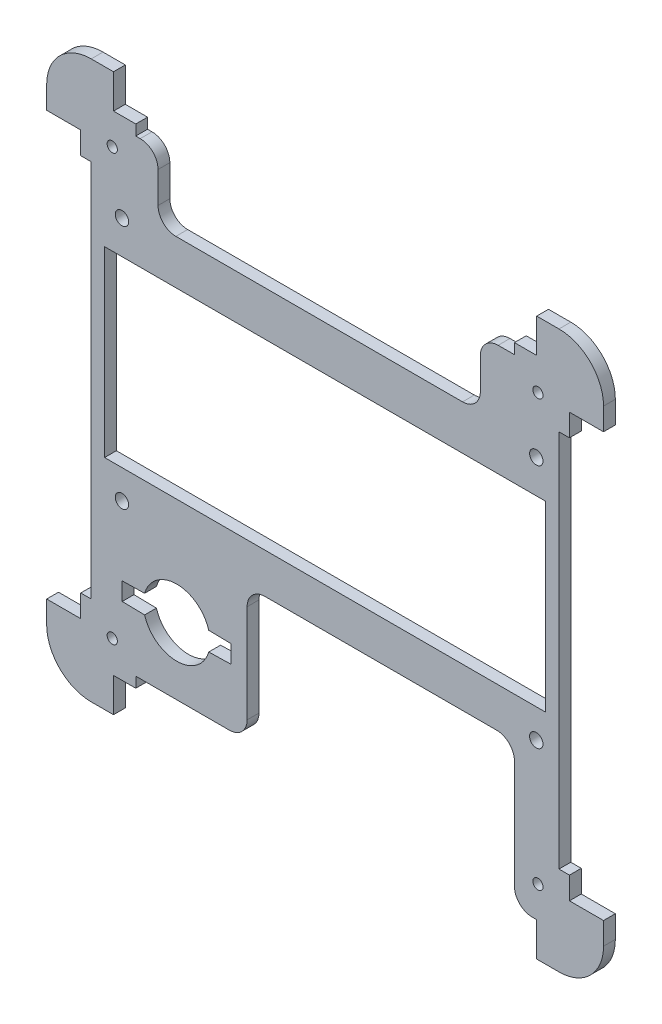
ISO-10303-21;
HEADER;
FILE_DESCRIPTION(('STEP AP214'),'2;1');
FILE_NAME('part.step','',(''),(''),'','','');
FILE_SCHEMA(('AUTOMOTIVE_DESIGN { 1 0 10303 214 1 1 1 1 }'));
ENDSEC;
DATA;
#1=APPLICATION_CONTEXT('core data for automotive mechanical design processes');
#2=APPLICATION_PROTOCOL_DEFINITION('international standard','automotive_design',2000,#1);
#3=PRODUCT_CONTEXT('',#1,'mechanical');
#4=PRODUCT('Part','Part','',(#3));
#5=PRODUCT_RELATED_PRODUCT_CATEGORY('part','',(#4));
#6=PRODUCT_DEFINITION_FORMATION('','',#4);
#7=PRODUCT_DEFINITION_CONTEXT('part definition',#1,'design');
#8=PRODUCT_DEFINITION('design','',#6,#7);
#9=PRODUCT_DEFINITION_SHAPE('','',#8);
#10=(LENGTH_UNIT() NAMED_UNIT(*) SI_UNIT(.MILLI.,.METRE.));
#11=(NAMED_UNIT(*) PLANE_ANGLE_UNIT() SI_UNIT($,.RADIAN.));
#12=(NAMED_UNIT(*) SI_UNIT($,.STERADIAN.) SOLID_ANGLE_UNIT());
#13=UNCERTAINTY_MEASURE_WITH_UNIT(LENGTH_MEASURE(1.E-05),#10,'distance_accuracy_value','');
#14=(GEOMETRIC_REPRESENTATION_CONTEXT(3) GLOBAL_UNCERTAINTY_ASSIGNED_CONTEXT((#13)) GLOBAL_UNIT_ASSIGNED_CONTEXT((#10,
#11,#12)) REPRESENTATION_CONTEXT('',''));
#15=CARTESIAN_POINT('',(0.,0.,0.));
#16=DIRECTION('',(0.,0.,1.));
#17=DIRECTION('',(1.,0.,0.));
#18=AXIS2_PLACEMENT_3D('',#15,#16,#17);
#19=CARTESIAN_POINT('',(0.,115.,172.50287751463));
#20=DIRECTION('',(0.,-1.,0.));
#21=DIRECTION('',(0.,0.,-1.));
#22=AXIS2_PLACEMENT_3D('',#19,#20,#21);
#23=PLANE('',#22);
#24=DIRECTION('',(-1.,0.,0.));
#25=VECTOR('',#24,1.);
#26=CARTESIAN_POINT('',(0.,115.,2.64999999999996));
#27=LINE('',#26,#25);
#28=CARTESIAN_POINT('',(21.,115.,2.64999999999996));
#29=VERTEX_POINT('',#28);
#30=CARTESIAN_POINT('',(20.,115.,2.64999999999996));
#31=VERTEX_POINT('',#30);
#32=EDGE_CURVE('E942',#29,#31,#27,.T.);
#33=ORIENTED_EDGE('',*,*,#32,.F.);
#34=DIRECTION('',(0.,0.,-1.));
#35=VECTOR('',#34,1.);
#36=CARTESIAN_POINT('',(21.,115.,172.50287751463));
#37=LINE('',#36,#35);
#38=CARTESIAN_POINT('',(21.,115.,0.));
#39=VERTEX_POINT('',#38);
#40=EDGE_CURVE('E924',#29,#39,#37,.T.);
#41=ORIENTED_EDGE('',*,*,#40,.T.);
#42=DIRECTION('',(-1.,0.,0.));
#43=VECTOR('',#42,1.);
#44=CARTESIAN_POINT('',(0.,115.,0.));
#45=LINE('',#44,#43);
#46=CARTESIAN_POINT('',(20.,115.,0.));
#47=VERTEX_POINT('',#46);
#48=EDGE_CURVE('E865',#39,#47,#45,.T.);
#49=ORIENTED_EDGE('',*,*,#48,.T.);
#50=DIRECTION('',(0.,0.,-1.));
#51=VECTOR('',#50,1.);
#52=CARTESIAN_POINT('',(20.,115.,172.50287751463));
#53=LINE('',#52,#51);
#54=EDGE_CURVE('E937',#31,#47,#53,.T.);
#55=ORIENTED_EDGE('',*,*,#54,.F.);
#56=EDGE_LOOP('',(#33,#41,#49,#55));
#57=FACE_BOUND('',#56,.T.);
#58=ADVANCED_FACE('F245',(#57),#23,.F.);
#59=CARTESIAN_POINT('',(0.,9.99999999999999,172.50287751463));
#60=DIRECTION('',(0.,-1.,0.));
#61=DIRECTION('',(0.,0.,-1.));
#62=AXIS2_PLACEMENT_3D('',#59,#60,#61);
#63=PLANE('',#62);
#64=DIRECTION('',(-1.,0.,0.));
#65=VECTOR('',#64,1.);
#66=CARTESIAN_POINT('',(0.,9.99999999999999,0.));
#67=LINE('',#66,#65);
#68=CARTESIAN_POINT('',(41.,9.99999999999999,0.));
#69=VERTEX_POINT('',#68);
#70=CARTESIAN_POINT('',(20.,9.99999999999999,0.));
#71=VERTEX_POINT('',#70);
#72=EDGE_CURVE('E823',#69,#71,#67,.T.);
#73=ORIENTED_EDGE('',*,*,#72,.F.);
#74=DIRECTION('',(0.,0.,1.));
#75=VECTOR('',#74,1.);
#76=CARTESIAN_POINT('',(41.,9.99999999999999,2.64999999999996));
#77=LINE('',#76,#75);
#78=CARTESIAN_POINT('',(41.,9.99999999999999,2.64999999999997));
#79=VERTEX_POINT('',#78);
#80=EDGE_CURVE('E1160',#69,#79,#77,.T.);
#81=ORIENTED_EDGE('',*,*,#80,.T.);
#82=DIRECTION('',(-1.,0.,0.));
#83=VECTOR('',#82,1.);
#84=CARTESIAN_POINT('',(0.,9.99999999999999,2.64999999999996));
#85=LINE('',#84,#83);
#86=CARTESIAN_POINT('',(20.,9.99999999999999,2.64999999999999));
#87=VERTEX_POINT('',#86);
#88=EDGE_CURVE('E907',#79,#87,#85,.T.);
#89=ORIENTED_EDGE('',*,*,#88,.T.);
#90=DIRECTION('',(0.,0.,-1.));
#91=VECTOR('',#90,1.);
#92=CARTESIAN_POINT('',(20.,9.99999999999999,172.50287751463));
#93=LINE('',#92,#91);
#94=EDGE_CURVE('E826',#87,#71,#93,.T.);
#95=ORIENTED_EDGE('',*,*,#94,.T.);
#96=EDGE_LOOP('',(#73,#81,#89,#95));
#97=FACE_BOUND('',#96,.T.);
#98=ADVANCED_FACE('F1226',(#97),#63,.T.);
#99=CARTESIAN_POINT('',(10.,0.,172.50287751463));
#100=DIRECTION('',(-1.,0.,0.));
#101=DIRECTION('',(0.,-1.,0.));
#102=AXIS2_PLACEMENT_3D('',#99,#100,#101);
#103=PLANE('',#102);
#104=DIRECTION('',(0.,0.,-1.));
#105=VECTOR('',#104,1.);
#106=CARTESIAN_POINT('',(9.99999999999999,20.,172.50287751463));
#107=LINE('',#106,#105);
#108=CARTESIAN_POINT('',(9.99999999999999,20.,2.64999999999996));
#109=VERTEX_POINT('',#108);
#110=CARTESIAN_POINT('',(9.99999999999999,20.,0.));
#111=VERTEX_POINT('',#110);
#112=EDGE_CURVE('E909',#109,#111,#107,.T.);
#113=ORIENTED_EDGE('',*,*,#112,.F.);
#114=DIRECTION('',(0.,1.,0.));
#115=VECTOR('',#114,1.);
#116=CARTESIAN_POINT('',(10.,0.,2.64999999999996));
#117=LINE('',#116,#115);
#118=CARTESIAN_POINT('',(9.99999999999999,105.,2.64999999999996));
#119=VERTEX_POINT('',#118);
#120=EDGE_CURVE('E910',#109,#119,#117,.T.);
#121=ORIENTED_EDGE('',*,*,#120,.T.);
#122=DIRECTION('',(0.,0.,-1.));
#123=VECTOR('',#122,1.);
#124=CARTESIAN_POINT('',(9.99999999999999,105.,172.50287751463));
#125=LINE('',#124,#123);
#126=CARTESIAN_POINT('',(9.99999999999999,105.,0.));
#127=VERTEX_POINT('',#126);
#128=EDGE_CURVE('E912',#119,#127,#125,.T.);
#129=ORIENTED_EDGE('',*,*,#128,.T.);
#130=DIRECTION('',(0.,1.,0.));
#131=VECTOR('',#130,1.);
#132=CARTESIAN_POINT('',(10.,0.,0.));
#133=LINE('',#132,#131);
#134=EDGE_CURVE('E825',#111,#127,#133,.T.);
#135=ORIENTED_EDGE('',*,*,#134,.F.);
#136=EDGE_LOOP('',(#113,#121,#129,#135));
#137=FACE_BOUND('',#136,.T.);
#138=ADVANCED_FACE('F1270',(#137),#103,.T.);
#139=CARTESIAN_POINT('',(0.,105.,172.50287751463));
#140=DIRECTION('',(0.,-1.,0.));
#141=DIRECTION('',(0.,0.,-1.));
#142=AXIS2_PLACEMENT_3D('',#139,#140,#141);
#143=PLANE('',#142);
#144=ORIENTED_EDGE('',*,*,#128,.F.);
#145=DIRECTION('',(-1.,0.,0.));
#146=VECTOR('',#145,1.);
#147=CARTESIAN_POINT('',(0.,105.,2.64999999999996));
#148=LINE('',#147,#146);
#149=CARTESIAN_POINT('',(7.64999999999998,105.,2.64999999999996));
#150=VERTEX_POINT('',#149);
#151=EDGE_CURVE('E914',#119,#150,#148,.T.);
#152=ORIENTED_EDGE('',*,*,#151,.T.);
#153=DIRECTION('',(0.,0.,-1.));
#154=VECTOR('',#153,1.);
#155=CARTESIAN_POINT('',(7.64999999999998,105.,172.50287751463));
#156=LINE('',#155,#154);
#157=CARTESIAN_POINT('',(7.64999999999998,105.,0.));
#158=VERTEX_POINT('',#157);
#159=EDGE_CURVE('E913',#150,#158,#156,.T.);
#160=ORIENTED_EDGE('',*,*,#159,.T.);
#161=DIRECTION('',(-1.,0.,0.));
#162=VECTOR('',#161,1.);
#163=CARTESIAN_POINT('',(0.,105.,0.));
#164=LINE('',#163,#162);
#165=EDGE_CURVE('E829',#127,#158,#164,.T.);
#166=ORIENTED_EDGE('',*,*,#165,.F.);
#167=EDGE_LOOP('',(#144,#152,#160,#166));
#168=FACE_BOUND('',#167,.T.);
#169=ADVANCED_FACE('F1275',(#168),#143,.T.);
#170=CARTESIAN_POINT('',(7.64999999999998,0.,172.50287751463));
#171=DIRECTION('',(-1.,0.,0.));
#172=DIRECTION('',(0.,0.,1.));
#173=AXIS2_PLACEMENT_3D('',#170,#171,#172);
#174=PLANE('',#173);
#175=ORIENTED_EDGE('',*,*,#159,.F.);
#176=DIRECTION('',(0.,1.,0.));
#177=VECTOR('',#176,1.);
#178=CARTESIAN_POINT('',(7.64999999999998,0.,2.64999999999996));
#179=LINE('',#178,#177);
#180=CARTESIAN_POINT('',(7.64999999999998,110.,2.64999999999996));
#181=VERTEX_POINT('',#180);
#182=EDGE_CURVE('E917',#150,#181,#179,.T.);
#183=ORIENTED_EDGE('',*,*,#182,.T.);
#184=DIRECTION('',(0.,0.,-1.));
#185=VECTOR('',#184,1.);
#186=CARTESIAN_POINT('',(7.64999999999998,110.,172.50287751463));
#187=LINE('',#186,#185);
#188=CARTESIAN_POINT('',(7.64999999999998,110.,0.));
#189=VERTEX_POINT('',#188);
#190=EDGE_CURVE('E916',#181,#189,#187,.T.);
#191=ORIENTED_EDGE('',*,*,#190,.T.);
#192=DIRECTION('',(0.,1.,0.));
#193=VECTOR('',#192,1.);
#194=CARTESIAN_POINT('',(7.64999999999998,0.,0.));
#195=LINE('',#194,#193);
#196=EDGE_CURVE('E832',#158,#189,#195,.T.);
#197=ORIENTED_EDGE('',*,*,#196,.F.);
#198=EDGE_LOOP('',(#175,#183,#191,#197));
#199=FACE_BOUND('',#198,.T.);
#200=ADVANCED_FACE('F1280',(#199),#174,.T.);
#201=CARTESIAN_POINT('',(0.,110.,172.50287751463));
#202=DIRECTION('',(0.,-1.,0.));
#203=DIRECTION('',(0.,0.,-1.));
#204=AXIS2_PLACEMENT_3D('',#201,#202,#203);
#205=PLANE('',#204);
#206=ORIENTED_EDGE('',*,*,#190,.F.);
#207=DIRECTION('',(-1.,0.,0.));
#208=VECTOR('',#207,1.);
#209=CARTESIAN_POINT('',(0.,110.,2.64999999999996));
#210=LINE('',#209,#208);
#211=CARTESIAN_POINT('',(0.,110.,2.64999999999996));
#212=VERTEX_POINT('',#211);
#213=EDGE_CURVE('E842',#181,#212,#210,.T.);
#214=ORIENTED_EDGE('',*,*,#213,.T.);
#215=DIRECTION('',(0.,0.,-1.));
#216=VECTOR('',#215,1.);
#217=CARTESIAN_POINT('',(0.,110.,172.50287751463));
#218=LINE('',#217,#216);
#219=CARTESIAN_POINT('',(0.,110.,0.));
#220=VERTEX_POINT('',#219);
#221=EDGE_CURVE('E919',#212,#220,#218,.T.);
#222=ORIENTED_EDGE('',*,*,#221,.T.);
#223=DIRECTION('',(-1.,0.,0.));
#224=VECTOR('',#223,1.);
#225=CARTESIAN_POINT('',(0.,110.,0.));
#226=LINE('',#225,#224);
#227=EDGE_CURVE('E835',#189,#220,#226,.T.);
#228=ORIENTED_EDGE('',*,*,#227,.F.);
#229=EDGE_LOOP('',(#206,#214,#222,#228));
#230=FACE_BOUND('',#229,.T.);
#231=ADVANCED_FACE('F1285',(#230),#205,.T.);
#232=CARTESIAN_POINT('',(1.24900090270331E-12,0.,172.50287751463));
#233=DIRECTION('',(1.,0.,0.));
#234=DIRECTION('',(0.,1.,0.));
#235=AXIS2_PLACEMENT_3D('',#232,#233,#234);
#236=PLANE('',#235);
#237=DIRECTION('',(0.,-1.,0.));
#238=VECTOR('',#237,1.);
#239=CARTESIAN_POINT('',(1.24900090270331E-12,0.,2.64999999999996));
#240=LINE('',#239,#238);
#241=CARTESIAN_POINT('',(0.,115.,2.64999999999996));
#242=VERTEX_POINT('',#241);
#243=EDGE_CURVE('E921',#242,#212,#240,.T.);
#244=ORIENTED_EDGE('',*,*,#243,.F.);
#245=DIRECTION('',(0.,0.,-1.));
#246=VECTOR('',#245,1.);
#247=CARTESIAN_POINT('',(0.,115.,172.50287751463));
#248=LINE('',#247,#246);
#249=CARTESIAN_POINT('',(0.,115.,0.));
#250=VERTEX_POINT('',#249);
#251=EDGE_CURVE('E843',#242,#250,#248,.T.);
#252=ORIENTED_EDGE('',*,*,#251,.T.);
#253=DIRECTION('',(0.,-1.,0.));
#254=VECTOR('',#253,1.);
#255=CARTESIAN_POINT('',(1.24900090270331E-12,0.,0.));
#256=LINE('',#255,#254);
#257=EDGE_CURVE('E839',#250,#220,#256,.T.);
#258=ORIENTED_EDGE('',*,*,#257,.T.);
#259=ORIENTED_EDGE('',*,*,#221,.F.);
#260=EDGE_LOOP('',(#244,#252,#258,#259));
#261=FACE_BOUND('',#260,.T.);
#262=ADVANCED_FACE('F2006',(#261),#236,.F.);
#263=CARTESIAN_POINT('',(9.99999999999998,115.,172.50287751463));
#264=DIRECTION('',(0.,0.,-1.));
#265=DIRECTION('',(-1.,0.,0.));
#266=AXIS2_PLACEMENT_3D('',#263,#264,#265);
#267=CYLINDRICAL_SURFACE('',#266,10.);
#268=ORIENTED_EDGE('',*,*,#251,.F.);
#269=CARTESIAN_POINT('',(9.99999999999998,115.,2.64999999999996));
#270=DIRECTION('',(0.,0.,1.));
#271=DIRECTION('',(1.,0.,0.));
#272=AXIS2_PLACEMENT_3D('',#269,#270,#271);
#273=CIRCLE('',#272,10.);
#274=CARTESIAN_POINT('',(9.99999999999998,125.,2.64999999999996));
#275=VERTEX_POINT('',#274);
#276=EDGE_CURVE('E850',#242,#275,#273,.F.);
#277=ORIENTED_EDGE('',*,*,#276,.T.);
#278=DIRECTION('',(0.,0.,-1.));
#279=VECTOR('',#278,1.);
#280=CARTESIAN_POINT('',(9.99999999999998,125.,172.50287751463));
#281=LINE('',#280,#279);
#282=CARTESIAN_POINT('',(9.99999999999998,125.,0.));
#283=VERTEX_POINT('',#282);
#284=EDGE_CURVE('E927',#275,#283,#281,.T.);
#285=ORIENTED_EDGE('',*,*,#284,.T.);
#286=CARTESIAN_POINT('',(9.99999999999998,115.,0.));
#287=DIRECTION('',(0.,0.,1.));
#288=DIRECTION('',(1.,0.,0.));
#289=AXIS2_PLACEMENT_3D('',#286,#287,#288);
#290=CIRCLE('',#289,10.);
#291=EDGE_CURVE('E838',#250,#283,#290,.F.);
#292=ORIENTED_EDGE('',*,*,#291,.F.);
#293=EDGE_LOOP('',(#268,#277,#285,#292));
#294=FACE_BOUND('',#293,.T.);
#295=ADVANCED_FACE('F1293',(#294),#267,.T.);
#296=CARTESIAN_POINT('',(0.,125.,172.50287751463));
#297=DIRECTION('',(0.,-1.,0.));
#298=DIRECTION('',(0.,0.,-1.));
#299=AXIS2_PLACEMENT_3D('',#296,#297,#298);
#300=PLANE('',#299);
#301=DIRECTION('',(-1.,0.,0.));
#302=VECTOR('',#301,1.);
#303=CARTESIAN_POINT('',(0.,125.,2.64999999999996));
#304=LINE('',#303,#302);
#305=CARTESIAN_POINT('',(15.,125.,2.64999999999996));
#306=VERTEX_POINT('',#305);
#307=EDGE_CURVE('E925',#306,#275,#304,.T.);
#308=ORIENTED_EDGE('',*,*,#307,.F.);
#309=DIRECTION('',(0.,0.,-1.));
#310=VECTOR('',#309,1.);
#311=CARTESIAN_POINT('',(15.,125.,172.50287751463));
#312=LINE('',#311,#310);
#313=CARTESIAN_POINT('',(15.,125.,0.));
#314=VERTEX_POINT('',#313);
#315=EDGE_CURVE('E851',#306,#314,#312,.T.);
#316=ORIENTED_EDGE('',*,*,#315,.T.);
#317=DIRECTION('',(-1.,0.,0.));
#318=VECTOR('',#317,1.);
#319=CARTESIAN_POINT('',(0.,125.,0.));
#320=LINE('',#319,#318);
#321=EDGE_CURVE('E847',#314,#283,#320,.T.);
#322=ORIENTED_EDGE('',*,*,#321,.T.);
#323=ORIENTED_EDGE('',*,*,#284,.F.);
#324=EDGE_LOOP('',(#308,#316,#322,#323));
#325=FACE_BOUND('',#324,.T.);
#326=ADVANCED_FACE('F1297',(#325),#300,.F.);
#327=CARTESIAN_POINT('',(14.9999999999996,0.,172.50287751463));
#328=DIRECTION('',(1.,0.,0.));
#329=DIRECTION('',(0.,1.,0.));
#330=AXIS2_PLACEMENT_3D('',#327,#328,#329);
#331=PLANE('',#330);
#332=ORIENTED_EDGE('',*,*,#315,.F.);
#333=DIRECTION('',(0.,-1.,0.));
#334=VECTOR('',#333,1.);
#335=CARTESIAN_POINT('',(14.9999999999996,0.,2.64999999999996));
#336=LINE('',#335,#334);
#337=CARTESIAN_POINT('',(15.,117.35,2.64999999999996));
#338=VERTEX_POINT('',#337);
#339=EDGE_CURVE('E931',#306,#338,#336,.T.);
#340=ORIENTED_EDGE('',*,*,#339,.T.);
#341=DIRECTION('',(0.,0.,-1.));
#342=VECTOR('',#341,1.);
#343=CARTESIAN_POINT('',(15.,117.35,172.50287751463));
#344=LINE('',#343,#342);
#345=CARTESIAN_POINT('',(15.,117.35,0.));
#346=VERTEX_POINT('',#345);
#347=EDGE_CURVE('E933',#338,#346,#344,.T.);
#348=ORIENTED_EDGE('',*,*,#347,.T.);
#349=DIRECTION('',(0.,-1.,0.));
#350=VECTOR('',#349,1.);
#351=CARTESIAN_POINT('',(14.9999999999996,0.,0.));
#352=LINE('',#351,#350);
#353=EDGE_CURVE('E846',#314,#346,#352,.T.);
#354=ORIENTED_EDGE('',*,*,#353,.F.);
#355=EDGE_LOOP('',(#332,#340,#348,#354));
#356=FACE_BOUND('',#355,.T.);
#357=ADVANCED_FACE('F1301',(#356),#331,.T.);
#358=CARTESIAN_POINT('',(-3.25711679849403E-13,117.35,172.50287751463));
#359=DIRECTION('',(0.,1.,0.));
#360=DIRECTION('',(-1.,0.,0.));
#361=AXIS2_PLACEMENT_3D('',#358,#359,#360);
#362=PLANE('',#361);
#363=ORIENTED_EDGE('',*,*,#347,.F.);
#364=DIRECTION('',(1.,0.,0.));
#365=VECTOR('',#364,1.);
#366=CARTESIAN_POINT('',(-2.72282216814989E-13,117.35,2.64999999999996));
#367=LINE('',#366,#365);
#368=CARTESIAN_POINT('',(20.,117.35,2.64999999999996));
#369=VERTEX_POINT('',#368);
#370=EDGE_CURVE('E935',#338,#369,#367,.T.);
#371=ORIENTED_EDGE('',*,*,#370,.T.);
#372=DIRECTION('',(0.,0.,-1.));
#373=VECTOR('',#372,1.);
#374=CARTESIAN_POINT('',(20.,117.35,172.50287751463));
#375=LINE('',#374,#373);
#376=CARTESIAN_POINT('',(20.,117.35,0.));
#377=VERTEX_POINT('',#376);
#378=EDGE_CURVE('E934',#369,#377,#375,.T.);
#379=ORIENTED_EDGE('',*,*,#378,.T.);
#380=DIRECTION('',(1.,0.,0.));
#381=VECTOR('',#380,1.);
#382=CARTESIAN_POINT('',(-3.25711679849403E-13,117.35,0.));
#383=LINE('',#382,#381);
#384=EDGE_CURVE('E854',#346,#377,#383,.T.);
#385=ORIENTED_EDGE('',*,*,#384,.F.);
#386=EDGE_LOOP('',(#363,#371,#379,#385));
#387=FACE_BOUND('',#386,.T.);
#388=ADVANCED_FACE('F1307',(#387),#362,.T.);
#389=CARTESIAN_POINT('',(20.0000000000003,0.,172.50287751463));
#390=DIRECTION('',(1.,0.,0.));
#391=DIRECTION('',(0.,1.,0.));
#392=AXIS2_PLACEMENT_3D('',#389,#390,#391);
#393=PLANE('',#392);
#394=ORIENTED_EDGE('',*,*,#378,.F.);
#395=DIRECTION('',(0.,-1.,0.));
#396=VECTOR('',#395,1.);
#397=CARTESIAN_POINT('',(20.0000000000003,0.,2.64999999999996));
#398=LINE('',#397,#396);
#399=EDGE_CURVE('E864',#369,#31,#398,.T.);
#400=ORIENTED_EDGE('',*,*,#399,.T.);
#401=ORIENTED_EDGE('',*,*,#54,.T.);
#402=DIRECTION('',(0.,-1.,0.));
#403=VECTOR('',#402,1.);
#404=CARTESIAN_POINT('',(20.0000000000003,0.,0.));
#405=LINE('',#404,#403);
#406=EDGE_CURVE('E857',#377,#47,#405,.T.);
#407=ORIENTED_EDGE('',*,*,#406,.F.);
#408=EDGE_LOOP('',(#394,#400,#401,#407));
#409=FACE_BOUND('',#408,.T.);
#410=ADVANCED_FACE('F1311',(#409),#393,.T.);
#411=CARTESIAN_POINT('',(105.,115.,0.));
#412=VERTEX_POINT('',#411);
#413=CARTESIAN_POINT('',(101.35,115.,0.));
#414=VERTEX_POINT('',#413);
#415=EDGE_CURVE('E861',#412,#414,#45,.T.);
#416=ORIENTED_EDGE('',*,*,#415,.T.);
#417=DIRECTION('',(0.,0.,-1.));
#418=VECTOR('',#417,1.);
#419=CARTESIAN_POINT('',(101.35,115.,172.50287751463));
#420=LINE('',#419,#418);
#421=CARTESIAN_POINT('',(101.35,115.,2.64999999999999));
#422=VERTEX_POINT('',#421);
#423=EDGE_CURVE('E1154',#414,#422,#420,.F.);
#424=ORIENTED_EDGE('',*,*,#423,.T.);
#425=CARTESIAN_POINT('',(105.,115.,2.64999999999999));
#426=VERTEX_POINT('',#425);
#427=EDGE_CURVE('E930',#426,#422,#27,.T.);
#428=ORIENTED_EDGE('',*,*,#427,.F.);
#429=DIRECTION('',(0.,0.,-1.));
#430=VECTOR('',#429,1.);
#431=CARTESIAN_POINT('',(105.,115.,172.50287751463));
#432=LINE('',#431,#430);
#433=EDGE_CURVE('E869',#426,#412,#432,.T.);
#434=ORIENTED_EDGE('',*,*,#433,.T.);
#435=EDGE_LOOP('',(#416,#424,#428,#434));
#436=FACE_BOUND('',#435,.T.);
#437=ADVANCED_FACE('F1368',(#436),#23,.F.);
#438=CARTESIAN_POINT('',(105.,0.,172.50287751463));
#439=DIRECTION('',(1.,0.,0.));
#440=DIRECTION('',(0.,0.,-1.));
#441=AXIS2_PLACEMENT_3D('',#438,#439,#440);
#442=PLANE('',#441);
#443=DIRECTION('',(0.,-1.,0.));
#444=VECTOR('',#443,1.);
#445=CARTESIAN_POINT('',(105.,0.,2.64999999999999));
#446=LINE('',#445,#444);
#447=CARTESIAN_POINT('',(105.,117.35,2.64999999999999));
#448=VERTEX_POINT('',#447);
#449=EDGE_CURVE('E943',#448,#426,#446,.T.);
#450=ORIENTED_EDGE('',*,*,#449,.F.);
#451=DIRECTION('',(0.,0.,-1.));
#452=VECTOR('',#451,1.);
#453=CARTESIAN_POINT('',(105.,117.35,172.50287751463));
#454=LINE('',#453,#452);
#455=CARTESIAN_POINT('',(105.,117.35,0.));
#456=VERTEX_POINT('',#455);
#457=EDGE_CURVE('E870',#448,#456,#454,.T.);
#458=ORIENTED_EDGE('',*,*,#457,.T.);
#459=DIRECTION('',(0.,-1.,0.));
#460=VECTOR('',#459,1.);
#461=CARTESIAN_POINT('',(105.,0.,0.));
#462=LINE('',#461,#460);
#463=EDGE_CURVE('E866',#456,#412,#462,.T.);
#464=ORIENTED_EDGE('',*,*,#463,.T.);
#465=ORIENTED_EDGE('',*,*,#433,.F.);
#466=EDGE_LOOP('',(#450,#458,#464,#465));
#467=FACE_BOUND('',#466,.T.);
#468=ADVANCED_FACE('F1376',(#467),#442,.F.);
#469=CARTESIAN_POINT('',(3.25711679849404E-13,117.35,172.50287751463));
#470=DIRECTION('',(0.,-1.,0.));
#471=DIRECTION('',(1.,0.,0.));
#472=AXIS2_PLACEMENT_3D('',#469,#470,#471);
#473=PLANE('',#472);
#474=DIRECTION('',(-1.,0.,0.));
#475=VECTOR('',#474,1.);
#476=CARTESIAN_POINT('',(3.79141142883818E-13,117.35,2.64999999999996));
#477=LINE('',#476,#475);
#478=CARTESIAN_POINT('',(110.,117.35,2.64999999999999));
#479=VERTEX_POINT('',#478);
#480=EDGE_CURVE('E946',#479,#448,#477,.T.);
#481=ORIENTED_EDGE('',*,*,#480,.F.);
#482=DIRECTION('',(0.,0.,-1.));
#483=VECTOR('',#482,1.);
#484=CARTESIAN_POINT('',(110.,117.35,172.50287751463));
#485=LINE('',#484,#483);
#486=CARTESIAN_POINT('',(110.,117.35,0.));
#487=VERTEX_POINT('',#486);
#488=EDGE_CURVE('E874',#479,#487,#485,.T.);
#489=ORIENTED_EDGE('',*,*,#488,.T.);
#490=DIRECTION('',(-1.,0.,0.));
#491=VECTOR('',#490,1.);
#492=CARTESIAN_POINT('',(3.25711679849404E-13,117.35,0.));
#493=LINE('',#492,#491);
#494=EDGE_CURVE('E871',#487,#456,#493,.T.);
#495=ORIENTED_EDGE('',*,*,#494,.T.);
#496=ORIENTED_EDGE('',*,*,#457,.F.);
#497=EDGE_LOOP('',(#481,#489,#495,#496));
#498=FACE_BOUND('',#497,.T.);
#499=ADVANCED_FACE('F1952',(#498),#473,.F.);
#500=CARTESIAN_POINT('',(110.,0.,172.50287751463));
#501=DIRECTION('',(1.,0.,0.));
#502=DIRECTION('',(0.,0.,-1.));
#503=AXIS2_PLACEMENT_3D('',#500,#501,#502);
#504=PLANE('',#503);
#505=DIRECTION('',(0.,-1.,0.));
#506=VECTOR('',#505,1.);
#507=CARTESIAN_POINT('',(110.,0.,2.64999999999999));
#508=LINE('',#507,#506);
#509=CARTESIAN_POINT('',(110.,125.,2.64999999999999));
#510=VERTEX_POINT('',#509);
#511=EDGE_CURVE('E949',#510,#479,#508,.T.);
#512=ORIENTED_EDGE('',*,*,#511,.F.);
#513=DIRECTION('',(0.,0.,-1.));
#514=VECTOR('',#513,1.);
#515=CARTESIAN_POINT('',(110.,125.,172.50287751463));
#516=LINE('',#515,#514);
#517=CARTESIAN_POINT('',(110.,125.,0.));
#518=VERTEX_POINT('',#517);
#519=EDGE_CURVE('E878',#510,#518,#516,.T.);
#520=ORIENTED_EDGE('',*,*,#519,.T.);
#521=DIRECTION('',(0.,-1.,0.));
#522=VECTOR('',#521,1.);
#523=CARTESIAN_POINT('',(110.,0.,0.));
#524=LINE('',#523,#522);
#525=EDGE_CURVE('E875',#518,#487,#524,.T.);
#526=ORIENTED_EDGE('',*,*,#525,.T.);
#527=ORIENTED_EDGE('',*,*,#488,.F.);
#528=EDGE_LOOP('',(#512,#520,#526,#527));
#529=FACE_BOUND('',#528,.T.);
#530=ADVANCED_FACE('F1942',(#529),#504,.F.);
#531=CARTESIAN_POINT('',(0.,125.,172.50287751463));
#532=DIRECTION('',(0.,1.,0.));
#533=DIRECTION('',(0.,0.,1.));
#534=AXIS2_PLACEMENT_3D('',#531,#532,#533);
#535=PLANE('',#534);
#536=ORIENTED_EDGE('',*,*,#519,.F.);
#537=DIRECTION('',(1.,0.,0.));
#538=VECTOR('',#537,1.);
#539=CARTESIAN_POINT('',(0.,125.,2.64999999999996));
#540=LINE('',#539,#538);
#541=CARTESIAN_POINT('',(115.,125.,2.64999999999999));
#542=VERTEX_POINT('',#541);
#543=EDGE_CURVE('E885',#510,#542,#540,.T.);
#544=ORIENTED_EDGE('',*,*,#543,.T.);
#545=DIRECTION('',(0.,0.,-1.));
#546=VECTOR('',#545,1.);
#547=CARTESIAN_POINT('',(115.,125.,172.50287751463));
#548=LINE('',#547,#546);
#549=CARTESIAN_POINT('',(115.,125.,0.));
#550=VERTEX_POINT('',#549);
#551=EDGE_CURVE('E954',#542,#550,#548,.T.);
#552=ORIENTED_EDGE('',*,*,#551,.T.);
#553=DIRECTION('',(1.,0.,0.));
#554=VECTOR('',#553,1.);
#555=CARTESIAN_POINT('',(0.,125.,0.));
#556=LINE('',#555,#554);
#557=EDGE_CURVE('E860',#518,#550,#556,.T.);
#558=ORIENTED_EDGE('',*,*,#557,.F.);
#559=EDGE_LOOP('',(#536,#544,#552,#558));
#560=FACE_BOUND('',#559,.T.);
#561=ADVANCED_FACE('F1932',(#560),#535,.T.);
#562=CARTESIAN_POINT('',(115.,115.,172.50287751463));
#563=DIRECTION('',(0.,0.,-1.));
#564=DIRECTION('',(-1.,0.,0.));
#565=AXIS2_PLACEMENT_3D('',#562,#563,#564);
#566=CYLINDRICAL_SURFACE('',#565,10.);
#567=CARTESIAN_POINT('',(115.,115.,2.64999999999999));
#568=DIRECTION('',(0.,0.,1.));
#569=DIRECTION('',(1.,0.,0.));
#570=AXIS2_PLACEMENT_3D('',#567,#568,#569);
#571=CIRCLE('',#570,10.);
#572=CARTESIAN_POINT('',(125.,115.,2.64999999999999));
#573=VERTEX_POINT('',#572);
#574=EDGE_CURVE('E952',#573,#542,#571,.T.);
#575=ORIENTED_EDGE('',*,*,#574,.F.);
#576=DIRECTION('',(0.,0.,-1.));
#577=VECTOR('',#576,1.);
#578=CARTESIAN_POINT('',(125.,115.,172.50287751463));
#579=LINE('',#578,#577);
#580=CARTESIAN_POINT('',(125.,115.,0.));
#581=VERTEX_POINT('',#580);
#582=EDGE_CURVE('E886',#573,#581,#579,.T.);
#583=ORIENTED_EDGE('',*,*,#582,.T.);
#584=CARTESIAN_POINT('',(115.,115.,0.));
#585=DIRECTION('',(0.,0.,1.));
#586=DIRECTION('',(1.,0.,0.));
#587=AXIS2_PLACEMENT_3D('',#584,#585,#586);
#588=CIRCLE('',#587,10.);
#589=EDGE_CURVE('E882',#581,#550,#588,.T.);
#590=ORIENTED_EDGE('',*,*,#589,.T.);
#591=ORIENTED_EDGE('',*,*,#551,.F.);
#592=EDGE_LOOP('',(#575,#583,#590,#591));
#593=FACE_BOUND('',#592,.T.);
#594=ADVANCED_FACE('F1922',(#593),#566,.T.);
#595=CARTESIAN_POINT('',(124.999999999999,-6.93889390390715E-13,172.50287751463));
#596=DIRECTION('',(1.,0.,0.));
#597=DIRECTION('',(0.,1.,0.));
#598=AXIS2_PLACEMENT_3D('',#595,#596,#597);
#599=PLANE('',#598);
#600=ORIENTED_EDGE('',*,*,#582,.F.);
#601=DIRECTION('',(0.,-1.,0.));
#602=VECTOR('',#601,1.);
#603=CARTESIAN_POINT('',(124.999999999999,-6.91780406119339E-13,2.64999999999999));
#604=LINE('',#603,#602);
#605=CARTESIAN_POINT('',(125.,110.,2.64999999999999));
#606=VERTEX_POINT('',#605);
#607=EDGE_CURVE('E893',#573,#606,#604,.T.);
#608=ORIENTED_EDGE('',*,*,#607,.T.);
#609=DIRECTION('',(0.,0.,-1.));
#610=VECTOR('',#609,1.);
#611=CARTESIAN_POINT('',(125.,110.,172.50287751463));
#612=LINE('',#611,#610);
#613=CARTESIAN_POINT('',(125.,110.,0.));
#614=VERTEX_POINT('',#613);
#615=EDGE_CURVE('E959',#606,#614,#612,.T.);
#616=ORIENTED_EDGE('',*,*,#615,.T.);
#617=DIRECTION('',(0.,-1.,0.));
#618=VECTOR('',#617,1.);
#619=CARTESIAN_POINT('',(124.999999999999,-6.93889390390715E-13,0.));
#620=LINE('',#619,#618);
#621=EDGE_CURVE('E881',#581,#614,#620,.T.);
#622=ORIENTED_EDGE('',*,*,#621,.F.);
#623=EDGE_LOOP('',(#600,#608,#616,#622));
#624=FACE_BOUND('',#623,.T.);
#625=ADVANCED_FACE('F1911',(#624),#599,.T.);
#626=CARTESIAN_POINT('',(0.,110.,172.50287751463));
#627=DIRECTION('',(0.,1.,0.));
#628=DIRECTION('',(0.,0.,1.));
#629=AXIS2_PLACEMENT_3D('',#626,#627,#628);
#630=PLANE('',#629);
#631=DIRECTION('',(1.,0.,0.));
#632=VECTOR('',#631,1.);
#633=CARTESIAN_POINT('',(0.,110.,2.64999999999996));
#634=LINE('',#633,#632);
#635=CARTESIAN_POINT('',(117.35,110.,2.64999999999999));
#636=VERTEX_POINT('',#635);
#637=EDGE_CURVE('E957',#636,#606,#634,.T.);
#638=ORIENTED_EDGE('',*,*,#637,.F.);
#639=DIRECTION('',(0.,0.,-1.));
#640=VECTOR('',#639,1.);
#641=CARTESIAN_POINT('',(117.35,110.,172.50287751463));
#642=LINE('',#641,#640);
#643=CARTESIAN_POINT('',(117.35,110.,0.));
#644=VERTEX_POINT('',#643);
#645=EDGE_CURVE('E894',#636,#644,#642,.T.);
#646=ORIENTED_EDGE('',*,*,#645,.T.);
#647=DIRECTION('',(1.,0.,0.));
#648=VECTOR('',#647,1.);
#649=CARTESIAN_POINT('',(0.,110.,0.));
#650=LINE('',#649,#648);
#651=EDGE_CURVE('E890',#644,#614,#650,.T.);
#652=ORIENTED_EDGE('',*,*,#651,.T.);
#653=ORIENTED_EDGE('',*,*,#615,.F.);
#654=EDGE_LOOP('',(#638,#646,#652,#653));
#655=FACE_BOUND('',#654,.T.);
#656=ADVANCED_FACE('F1901',(#655),#630,.F.);
#657=CARTESIAN_POINT('',(117.35,0.,172.50287751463));
#658=DIRECTION('',(-1.,0.,0.));
#659=DIRECTION('',(0.,0.,1.));
#660=AXIS2_PLACEMENT_3D('',#657,#658,#659);
#661=PLANE('',#660);
#662=DIRECTION('',(0.,1.,0.));
#663=VECTOR('',#662,1.);
#664=CARTESIAN_POINT('',(117.35,0.,2.64999999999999));
#665=LINE('',#664,#663);
#666=CARTESIAN_POINT('',(117.35,105.,2.64999999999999));
#667=VERTEX_POINT('',#666);
#668=EDGE_CURVE('E962',#667,#636,#665,.T.);
#669=ORIENTED_EDGE('',*,*,#668,.F.);
#670=DIRECTION('',(0.,0.,-1.));
#671=VECTOR('',#670,1.);
#672=CARTESIAN_POINT('',(117.35,105.,172.50287751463));
#673=LINE('',#672,#671);
#674=CARTESIAN_POINT('',(117.35,105.,0.));
#675=VERTEX_POINT('',#674);
#676=EDGE_CURVE('E898',#667,#675,#673,.T.);
#677=ORIENTED_EDGE('',*,*,#676,.T.);
#678=DIRECTION('',(0.,1.,0.));
#679=VECTOR('',#678,1.);
#680=CARTESIAN_POINT('',(117.35,0.,0.));
#681=LINE('',#680,#679);
#682=EDGE_CURVE('E895',#675,#644,#681,.T.);
#683=ORIENTED_EDGE('',*,*,#682,.T.);
#684=ORIENTED_EDGE('',*,*,#645,.F.);
#685=EDGE_LOOP('',(#669,#677,#683,#684));
#686=FACE_BOUND('',#685,.T.);
#687=ADVANCED_FACE('F1891',(#686),#661,.F.);
#688=CARTESIAN_POINT('',(0.,105.,172.50287751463));
#689=DIRECTION('',(0.,1.,0.));
#690=DIRECTION('',(0.,0.,1.));
#691=AXIS2_PLACEMENT_3D('',#688,#689,#690);
#692=PLANE('',#691);
#693=DIRECTION('',(1.,0.,0.));
#694=VECTOR('',#693,1.);
#695=CARTESIAN_POINT('',(0.,105.,2.64999999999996));
#696=LINE('',#695,#694);
#697=CARTESIAN_POINT('',(115.,105.,2.64999999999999));
#698=VERTEX_POINT('',#697);
#699=EDGE_CURVE('E965',#698,#667,#696,.T.);
#700=ORIENTED_EDGE('',*,*,#699,.F.);
#701=DIRECTION('',(0.,0.,-1.));
#702=VECTOR('',#701,1.);
#703=CARTESIAN_POINT('',(115.,105.,172.50287751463));
#704=LINE('',#703,#702);
#705=CARTESIAN_POINT('',(115.,105.,0.));
#706=VERTEX_POINT('',#705);
#707=EDGE_CURVE('E902',#698,#706,#704,.T.);
#708=ORIENTED_EDGE('',*,*,#707,.T.);
#709=DIRECTION('',(1.,0.,0.));
#710=VECTOR('',#709,1.);
#711=CARTESIAN_POINT('',(0.,105.,0.));
#712=LINE('',#711,#710);
#713=EDGE_CURVE('E899',#706,#675,#712,.T.);
#714=ORIENTED_EDGE('',*,*,#713,.T.);
#715=ORIENTED_EDGE('',*,*,#676,.F.);
#716=EDGE_LOOP('',(#700,#708,#714,#715));
#717=FACE_BOUND('',#716,.T.);
#718=ADVANCED_FACE('F1881',(#717),#692,.F.);
#719=CARTESIAN_POINT('',(115.,0.,172.50287751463));
#720=DIRECTION('',(-1.,0.,0.));
#721=DIRECTION('',(0.,0.,1.));
#722=AXIS2_PLACEMENT_3D('',#719,#720,#721);
#723=PLANE('',#722);
#724=DIRECTION('',(0.,1.,0.));
#725=VECTOR('',#724,1.);
#726=CARTESIAN_POINT('',(115.,0.,2.64999999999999));
#727=LINE('',#726,#725);
#728=CARTESIAN_POINT('',(115.,20.,2.64999999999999));
#729=VERTEX_POINT('',#728);
#730=EDGE_CURVE('E889',#729,#698,#727,.T.);
#731=ORIENTED_EDGE('',*,*,#730,.F.);
#732=DIRECTION('',(0.,0.,-1.));
#733=VECTOR('',#732,1.);
#734=CARTESIAN_POINT('',(115.,20.,172.50287751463));
#735=LINE('',#734,#733);
#736=CARTESIAN_POINT('',(115.,20.,0.));
#737=VERTEX_POINT('',#736);
#738=EDGE_CURVE('E906',#729,#737,#735,.T.);
#739=ORIENTED_EDGE('',*,*,#738,.T.);
#740=DIRECTION('',(0.,1.,0.));
#741=VECTOR('',#740,1.);
#742=CARTESIAN_POINT('',(115.,0.,0.));
#743=LINE('',#742,#741);
#744=EDGE_CURVE('E903',#737,#706,#743,.T.);
#745=ORIENTED_EDGE('',*,*,#744,.T.);
#746=ORIENTED_EDGE('',*,*,#707,.F.);
#747=EDGE_LOOP('',(#731,#739,#745,#746));
#748=FACE_BOUND('',#747,.T.);
#749=ADVANCED_FACE('F1557',(#748),#723,.F.);
#750=CARTESIAN_POINT('',(7.99999999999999,5.00000000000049,2.64999999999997));
#751=DIRECTION('',(0.,0.,1.));
#752=DIRECTION('',(0.,1.,0.));
#753=AXIS2_PLACEMENT_3D('',#750,#751,#752);
#754=PLANE('',#753);
#755=DIRECTION('',(0.,1.,0.));
#756=VECTOR('',#755,1.);
#757=CARTESIAN_POINT('',(25.,115.,2.64999999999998));
#758=LINE('',#757,#756);
#759=CARTESIAN_POINT('',(25.,104.,2.64999999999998));
#760=VERTEX_POINT('',#759);
#761=CARTESIAN_POINT('',(25.,111.,2.64999999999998));
#762=VERTEX_POINT('',#761);
#763=EDGE_CURVE('E1329',#760,#762,#758,.T.);
#764=ORIENTED_EDGE('',*,*,#763,.T.);
#765=CARTESIAN_POINT('',(21.,111.,2.64999999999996));
#766=DIRECTION('',(0.,0.,1.));
#767=DIRECTION('',(1.,0.,0.));
#768=AXIS2_PLACEMENT_3D('',#765,#766,#767);
#769=CIRCLE('',#768,4.);
#770=EDGE_CURVE('E1147',#762,#29,#769,.T.);
#771=ORIENTED_EDGE('',*,*,#770,.T.);
#772=ORIENTED_EDGE('',*,*,#32,.T.);
#773=ORIENTED_EDGE('',*,*,#399,.F.);
#774=ORIENTED_EDGE('',*,*,#370,.F.);
#775=ORIENTED_EDGE('',*,*,#339,.F.);
#776=ORIENTED_EDGE('',*,*,#307,.T.);
#777=ORIENTED_EDGE('',*,*,#276,.F.);
#778=ORIENTED_EDGE('',*,*,#243,.T.);
#779=ORIENTED_EDGE('',*,*,#213,.F.);
#780=ORIENTED_EDGE('',*,*,#182,.F.);
#781=ORIENTED_EDGE('',*,*,#151,.F.);
#782=ORIENTED_EDGE('',*,*,#120,.F.);
#783=DIRECTION('',(-1.,0.,0.));
#784=VECTOR('',#783,1.);
#785=CARTESIAN_POINT('',(20.0000000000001,20.,2.64999999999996));
#786=LINE('',#785,#784);
#787=CARTESIAN_POINT('',(7.64999999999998,20.,2.64999999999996));
#788=VERTEX_POINT('',#787);
#789=EDGE_CURVE('E1107',#109,#788,#786,.T.);
#790=ORIENTED_EDGE('',*,*,#789,.T.);
#791=DIRECTION('',(0.,-1.,0.));
#792=VECTOR('',#791,1.);
#793=CARTESIAN_POINT('',(7.64999999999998,20.,2.64999999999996));
#794=LINE('',#793,#792);
#795=CARTESIAN_POINT('',(7.64999999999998,15.,2.64999999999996));
#796=VERTEX_POINT('',#795);
#797=EDGE_CURVE('E1104',#788,#796,#794,.T.);
#798=ORIENTED_EDGE('',*,*,#797,.T.);
#799=DIRECTION('',(-1.,0.,0.));
#800=VECTOR('',#799,1.);
#801=CARTESIAN_POINT('',(7.65000000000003,15.,2.64999999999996));
#802=LINE('',#801,#800);
#803=CARTESIAN_POINT('',(0.,15.,2.64999999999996));
#804=VERTEX_POINT('',#803);
#805=EDGE_CURVE('E1099',#796,#804,#802,.T.);
#806=ORIENTED_EDGE('',*,*,#805,.T.);
#807=DIRECTION('',(0.,1.,0.));
#808=VECTOR('',#807,1.);
#809=CARTESIAN_POINT('',(0.,10.,2.64999999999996));
#810=LINE('',#809,#808);
#811=CARTESIAN_POINT('',(0.,9.99999999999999,2.64999999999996));
#812=VERTEX_POINT('',#811);
#813=EDGE_CURVE('E1080',#812,#804,#810,.T.);
#814=ORIENTED_EDGE('',*,*,#813,.F.);
#815=CARTESIAN_POINT('',(10.,9.99999999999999,2.64999999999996));
#816=DIRECTION('',(0.,0.,1.));
#817=DIRECTION('',(1.,0.,0.));
#818=AXIS2_PLACEMENT_3D('',#815,#816,#817);
#819=CIRCLE('',#818,10.);
#820=CARTESIAN_POINT('',(9.99999999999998,0.,2.64999999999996));
#821=VERTEX_POINT('',#820);
#822=EDGE_CURVE('E1040',#812,#821,#819,.T.);
#823=ORIENTED_EDGE('',*,*,#822,.T.);
#824=DIRECTION('',(-1.,0.,0.));
#825=VECTOR('',#824,1.);
#826=CARTESIAN_POINT('',(15.0000000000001,0.,2.64999999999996));
#827=LINE('',#826,#825);
#828=CARTESIAN_POINT('',(15.,0.,2.64999999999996));
#829=VERTEX_POINT('',#828);
#830=EDGE_CURVE('E1072',#829,#821,#827,.T.);
#831=ORIENTED_EDGE('',*,*,#830,.F.);
#832=DIRECTION('',(0.,1.,0.));
#833=VECTOR('',#832,1.);
#834=CARTESIAN_POINT('',(15.,0.,2.64999999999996));
#835=LINE('',#834,#833);
#836=CARTESIAN_POINT('',(15.,7.64999999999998,2.64999999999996));
#837=VERTEX_POINT('',#836);
#838=EDGE_CURVE('E1076',#829,#837,#835,.T.);
#839=ORIENTED_EDGE('',*,*,#838,.T.);
#840=DIRECTION('',(1.,0.,0.));
#841=VECTOR('',#840,1.);
#842=CARTESIAN_POINT('',(15.,7.64999999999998,2.64999999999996));
#843=LINE('',#842,#841);
#844=CARTESIAN_POINT('',(20.,7.64999999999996,2.64999999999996));
#845=VERTEX_POINT('',#844);
#846=EDGE_CURVE('E1112',#837,#845,#843,.T.);
#847=ORIENTED_EDGE('',*,*,#846,.T.);
#848=DIRECTION('',(0.,1.,0.));
#849=VECTOR('',#848,1.);
#850=CARTESIAN_POINT('',(20.,7.64999999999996,2.64999999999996));
#851=LINE('',#850,#849);
#852=EDGE_CURVE('E1109',#845,#87,#851,.T.);
#853=ORIENTED_EDGE('',*,*,#852,.T.);
#854=ORIENTED_EDGE('',*,*,#88,.F.);
#855=CARTESIAN_POINT('',(41.,14.,2.64999999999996));
#856=DIRECTION('',(0.,0.,1.));
#857=DIRECTION('',(1.,0.,0.));
#858=AXIS2_PLACEMENT_3D('',#855,#856,#857);
#859=CIRCLE('',#858,4.);
#860=CARTESIAN_POINT('',(45.,14.,2.64999999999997));
#861=VERTEX_POINT('',#860);
#862=EDGE_CURVE('E1143',#79,#861,#859,.T.);
#863=ORIENTED_EDGE('',*,*,#862,.T.);
#864=DIRECTION('',(0.,-1.,0.));
#865=VECTOR('',#864,1.);
#866=CARTESIAN_POINT('',(45.,9.99999999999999,2.64999999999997));
#867=LINE('',#866,#865);
#868=CARTESIAN_POINT('',(45.,36.,2.64999999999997));
#869=VERTEX_POINT('',#868);
#870=EDGE_CURVE('E729',#869,#861,#867,.T.);
#871=ORIENTED_EDGE('',*,*,#870,.F.);
#872=CARTESIAN_POINT('',(49.,36.,2.64999999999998));
#873=DIRECTION('',(0.,0.,1.));
#874=DIRECTION('',(1.,0.,0.));
#875=AXIS2_PLACEMENT_3D('',#872,#873,#874);
#876=CIRCLE('',#875,4.);
#877=CARTESIAN_POINT('',(49.,40.,2.64999999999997));
#878=VERTEX_POINT('',#877);
#879=EDGE_CURVE('E1187',#869,#878,#876,.F.);
#880=ORIENTED_EDGE('',*,*,#879,.T.);
#881=DIRECTION('',(-1.,0.,0.));
#882=VECTOR('',#881,1.);
#883=CARTESIAN_POINT('',(105.,40.,2.64999999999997));
#884=LINE('',#883,#882);
#885=CARTESIAN_POINT('',(101.,40.,2.64999999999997));
#886=VERTEX_POINT('',#885);
#887=EDGE_CURVE('E726',#886,#878,#884,.T.);
#888=ORIENTED_EDGE('',*,*,#887,.F.);
#889=CARTESIAN_POINT('',(101.,36.,2.65));
#890=DIRECTION('',(0.,0.,1.));
#891=DIRECTION('',(1.,0.,0.));
#892=AXIS2_PLACEMENT_3D('',#889,#890,#891);
#893=CIRCLE('',#892,4.);
#894=CARTESIAN_POINT('',(105.,36.,2.64999999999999));
#895=VERTEX_POINT('',#894);
#896=EDGE_CURVE('E253',#886,#895,#893,.F.);
#897=ORIENTED_EDGE('',*,*,#896,.T.);
#898=DIRECTION('',(0.,1.,0.));
#899=VECTOR('',#898,1.);
#900=CARTESIAN_POINT('',(105.,7.64999999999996,2.64999999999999));
#901=LINE('',#900,#899);
#902=CARTESIAN_POINT('',(105.,11.65,2.64999999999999));
#903=VERTEX_POINT('',#902);
#904=EDGE_CURVE('E995',#903,#895,#901,.T.);
#905=ORIENTED_EDGE('',*,*,#904,.F.);
#906=CARTESIAN_POINT('',(109.,11.65,2.64999999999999));
#907=DIRECTION('',(0.,0.,1.));
#908=DIRECTION('',(1.,0.,0.));
#909=AXIS2_PLACEMENT_3D('',#906,#907,#908);
#910=CIRCLE('',#909,4.);
#911=CARTESIAN_POINT('',(109.,7.64999999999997,2.64999999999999));
#912=VERTEX_POINT('',#911);
#913=EDGE_CURVE('E1141',#903,#912,#910,.T.);
#914=ORIENTED_EDGE('',*,*,#913,.T.);
#915=DIRECTION('',(-1.,0.,0.));
#916=VECTOR('',#915,1.);
#917=CARTESIAN_POINT('',(110.,7.64999999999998,2.64999999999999));
#918=LINE('',#917,#916);
#919=CARTESIAN_POINT('',(110.,7.64999999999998,2.64999999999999));
#920=VERTEX_POINT('',#919);
#921=EDGE_CURVE('E1032',#920,#912,#918,.T.);
#922=ORIENTED_EDGE('',*,*,#921,.F.);
#923=DIRECTION('',(0.,1.,0.));
#924=VECTOR('',#923,1.);
#925=CARTESIAN_POINT('',(110.,0.,2.64999999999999));
#926=LINE('',#925,#924);
#927=CARTESIAN_POINT('',(110.,0.,2.64999999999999));
#928=VERTEX_POINT('',#927);
#929=EDGE_CURVE('E1007',#928,#920,#926,.T.);
#930=ORIENTED_EDGE('',*,*,#929,.F.);
#931=DIRECTION('',(1.,0.,0.));
#932=VECTOR('',#931,1.);
#933=CARTESIAN_POINT('',(110.,0.,2.64999999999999));
#934=LINE('',#933,#932);
#935=CARTESIAN_POINT('',(115.,0.,2.64999999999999));
#936=VERTEX_POINT('',#935);
#937=EDGE_CURVE('E1038',#928,#936,#934,.T.);
#938=ORIENTED_EDGE('',*,*,#937,.T.);
#939=CARTESIAN_POINT('',(115.,9.99999999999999,2.64999999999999));
#940=DIRECTION('',(0.,0.,1.));
#941=DIRECTION('',(1.,0.,0.));
#942=AXIS2_PLACEMENT_3D('',#939,#940,#941);
#943=CIRCLE('',#942,10.);
#944=CARTESIAN_POINT('',(125.,9.99999999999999,2.64999999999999));
#945=VERTEX_POINT('',#944);
#946=EDGE_CURVE('E1015',#945,#936,#943,.F.);
#947=ORIENTED_EDGE('',*,*,#946,.F.);
#948=DIRECTION('',(0.,1.,0.));
#949=VECTOR('',#948,1.);
#950=CARTESIAN_POINT('',(125.,10.,2.64999999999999));
#951=LINE('',#950,#949);
#952=CARTESIAN_POINT('',(125.,15.,2.64999999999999));
#953=VERTEX_POINT('',#952);
#954=EDGE_CURVE('E1027',#945,#953,#951,.T.);
#955=ORIENTED_EDGE('',*,*,#954,.T.);
#956=DIRECTION('',(1.,0.,0.));
#957=VECTOR('',#956,1.);
#958=CARTESIAN_POINT('',(117.35,15.,2.64999999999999));
#959=LINE('',#958,#957);
#960=CARTESIAN_POINT('',(117.35,15.,2.64999999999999));
#961=VERTEX_POINT('',#960);
#962=EDGE_CURVE('E1045',#961,#953,#959,.T.);
#963=ORIENTED_EDGE('',*,*,#962,.F.);
#964=DIRECTION('',(0.,-1.,0.));
#965=VECTOR('',#964,1.);
#966=CARTESIAN_POINT('',(117.35,20.,2.64999999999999));
#967=LINE('',#966,#965);
#968=CARTESIAN_POINT('',(117.35,20.,2.64999999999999));
#969=VERTEX_POINT('',#968);
#970=EDGE_CURVE('E1050',#969,#961,#967,.T.);
#971=ORIENTED_EDGE('',*,*,#970,.F.);
#972=DIRECTION('',(1.,0.,0.));
#973=VECTOR('',#972,1.);
#974=CARTESIAN_POINT('',(105.,20.,2.64999999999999));
#975=LINE('',#974,#973);
#976=EDGE_CURVE('E999',#729,#969,#975,.T.);
#977=ORIENTED_EDGE('',*,*,#976,.F.);
#978=ORIENTED_EDGE('',*,*,#730,.T.);
#979=ORIENTED_EDGE('',*,*,#699,.T.);
#980=ORIENTED_EDGE('',*,*,#668,.T.);
#981=ORIENTED_EDGE('',*,*,#637,.T.);
#982=ORIENTED_EDGE('',*,*,#607,.F.);
#983=ORIENTED_EDGE('',*,*,#574,.T.);
#984=ORIENTED_EDGE('',*,*,#543,.F.);
#985=ORIENTED_EDGE('',*,*,#511,.T.);
#986=ORIENTED_EDGE('',*,*,#480,.T.);
#987=ORIENTED_EDGE('',*,*,#449,.T.);
#988=ORIENTED_EDGE('',*,*,#427,.T.);
#989=CARTESIAN_POINT('',(101.35,111.,2.65));
#990=DIRECTION('',(0.,0.,1.));
#991=DIRECTION('',(1.,0.,0.));
#992=AXIS2_PLACEMENT_3D('',#989,#990,#991);
#993=CIRCLE('',#992,4.);
#994=CARTESIAN_POINT('',(97.35,111.,2.64999999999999));
#995=VERTEX_POINT('',#994);
#996=EDGE_CURVE('E1145',#422,#995,#993,.T.);
#997=ORIENTED_EDGE('',*,*,#996,.T.);
#998=DIRECTION('',(0.,1.,0.));
#999=VECTOR('',#998,1.);
#1000=CARTESIAN_POINT('',(97.35,100.,2.64999999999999));
#1001=LINE('',#1000,#999);
#1002=CARTESIAN_POINT('',(97.35,104.,2.64999999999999));
#1003=VERTEX_POINT('',#1002);
#1004=EDGE_CURVE('E739',#1003,#995,#1001,.T.);
#1005=ORIENTED_EDGE('',*,*,#1004,.F.);
#1006=CARTESIAN_POINT('',(93.35,104.,2.65));
#1007=DIRECTION('',(0.,0.,1.));
#1008=DIRECTION('',(1.,0.,0.));
#1009=AXIS2_PLACEMENT_3D('',#1006,#1007,#1008);
#1010=CIRCLE('',#1009,4.);
#1011=CARTESIAN_POINT('',(93.35,100.,2.64999999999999));
#1012=VERTEX_POINT('',#1011);
#1013=EDGE_CURVE('E260',#1003,#1012,#1010,.F.);
#1014=ORIENTED_EDGE('',*,*,#1013,.T.);
#1015=DIRECTION('',(1.,0.,0.));
#1016=VECTOR('',#1015,1.);
#1017=CARTESIAN_POINT('',(78.35,100.,2.64999999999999));
#1018=LINE('',#1017,#1016);
#1019=CARTESIAN_POINT('',(29.,100.,2.64999999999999));
#1020=VERTEX_POINT('',#1019);
#1021=EDGE_CURVE('E735',#1020,#1012,#1018,.T.);
#1022=ORIENTED_EDGE('',*,*,#1021,.F.);
#1023=CARTESIAN_POINT('',(29.,104.,2.64999999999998));
#1024=DIRECTION('',(0.,0.,1.));
#1025=DIRECTION('',(1.,0.,0.));
#1026=AXIS2_PLACEMENT_3D('',#1023,#1024,#1025);
#1027=CIRCLE('',#1026,4.);
#1028=EDGE_CURVE('E1182',#1020,#760,#1027,.F.);
#1029=ORIENTED_EDGE('',*,*,#1028,.T.);
#1030=EDGE_LOOP('',(#764,#771,#772,#773,#774,#775,#776,#777,#778,#779,#780,#781,#782,#790,#798,
#806,#814,#823,#831,#839,#847,#853,#854,#863,#871,#880,#888,#897,#905,#914,#922,#930,#938,#947,
#955,#963,#971,#977,#978,#979,#980,#981,#982,#983,#984,#985,#986,#987,#988,#997,#1005,#1014,
#1022,#1029));
#1031=FACE_BOUND('',#1030,.T.);
#1032=CARTESIAN_POINT('',(29.1872027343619,25.,2.64999999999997));
#1033=DIRECTION('',(0.,0.,1.));
#1034=DIRECTION('',(1.,0.,0.));
#1035=AXIS2_PLACEMENT_3D('',#1032,#1033,#1034);
#1036=CIRCLE('',#1035,7.5);
#1037=CARTESIAN_POINT('',(36.386760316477,27.1015162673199,2.64999999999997));
#1038=VERTEX_POINT('',#1037);
#1039=CARTESIAN_POINT('',(21.9876451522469,27.1015162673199,2.64999999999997));
#1040=VERTEX_POINT('',#1039);
#1041=EDGE_CURVE('E666',#1038,#1040,#1036,.T.);
#1042=ORIENTED_EDGE('',*,*,#1041,.F.);
#1043=DIRECTION('',(-0.999796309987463,0.0201826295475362,0.));
#1044=VECTOR('',#1043,1.);
#1045=CARTESIAN_POINT('',(36.386760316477,27.1015162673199,2.64999999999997));
#1046=LINE('',#1045,#1044);
#1047=CARTESIAN_POINT('',(41.4156188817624,27.,2.64999999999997));
#1048=VERTEX_POINT('',#1047);
#1049=EDGE_CURVE('E671',#1048,#1038,#1046,.T.);
#1050=ORIENTED_EDGE('',*,*,#1049,.F.);
#1051=DIRECTION('',(0.,1.,0.));
#1052=VECTOR('',#1051,1.);
#1053=CARTESIAN_POINT('',(41.4156188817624,23.,2.64999999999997));
#1054=LINE('',#1053,#1052);
#1055=CARTESIAN_POINT('',(41.4156188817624,23.,2.64999999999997));
#1056=VERTEX_POINT('',#1055);
#1057=EDGE_CURVE('E707',#1056,#1048,#1054,.T.);
#1058=ORIENTED_EDGE('',*,*,#1057,.F.);
#1059=DIRECTION('',(0.999796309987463,0.0201826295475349,0.));
#1060=VECTOR('',#1059,1.);
#1061=CARTESIAN_POINT('',(36.386760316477,22.8984837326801,2.64999999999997));
#1062=LINE('',#1061,#1060);
#1063=CARTESIAN_POINT('',(36.386760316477,22.8984837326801,2.64999999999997));
#1064=VERTEX_POINT('',#1063);
#1065=EDGE_CURVE('E704',#1064,#1056,#1062,.T.);
#1066=ORIENTED_EDGE('',*,*,#1065,.F.);
#1067=CARTESIAN_POINT('',(29.1872027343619,25.,2.64999999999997));
#1068=DIRECTION('',(0.,0.,1.));
#1069=DIRECTION('',(1.,0.,0.));
#1070=AXIS2_PLACEMENT_3D('',#1067,#1068,#1069);
#1071=CIRCLE('',#1070,7.5);
#1072=CARTESIAN_POINT('',(21.9876451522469,22.8984837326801,2.64999999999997));
#1073=VERTEX_POINT('',#1072);
#1074=EDGE_CURVE('E701',#1073,#1064,#1071,.T.);
#1075=ORIENTED_EDGE('',*,*,#1074,.F.);
#1076=DIRECTION('',(0.999796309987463,-0.0201826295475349,0.));
#1077=VECTOR('',#1076,1.);
#1078=CARTESIAN_POINT('',(21.9876451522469,22.8984837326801,2.64999999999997));
#1079=LINE('',#1078,#1077);
#1080=CARTESIAN_POINT('',(16.9587865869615,23.,2.64999999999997));
#1081=VERTEX_POINT('',#1080);
#1082=EDGE_CURVE('E698',#1081,#1073,#1079,.T.);
#1083=ORIENTED_EDGE('',*,*,#1082,.F.);
#1084=DIRECTION('',(0.,-1.,0.));
#1085=VECTOR('',#1084,1.);
#1086=CARTESIAN_POINT('',(16.9587865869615,23.,2.64999999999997));
#1087=LINE('',#1086,#1085);
#1088=CARTESIAN_POINT('',(16.9587865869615,27.,2.64999999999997));
#1089=VERTEX_POINT('',#1088);
#1090=EDGE_CURVE('E695',#1089,#1081,#1087,.T.);
#1091=ORIENTED_EDGE('',*,*,#1090,.F.);
#1092=DIRECTION('',(-0.999796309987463,-0.0201826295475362,0.));
#1093=VECTOR('',#1092,1.);
#1094=CARTESIAN_POINT('',(21.9876451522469,27.1015162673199,2.64999999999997));
#1095=LINE('',#1094,#1093);
#1096=EDGE_CURVE('E688',#1040,#1089,#1095,.T.);
#1097=ORIENTED_EDGE('',*,*,#1096,.F.);
#1098=EDGE_LOOP('',(#1042,#1050,#1058,#1066,#1075,#1083,#1091,#1097));
#1099=FACE_BOUND('',#1098,.T.);
#1100=CARTESIAN_POINT('',(16.9,97.5,2.64999999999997));
#1101=DIRECTION('',(0.,0.,1.));
#1102=DIRECTION('',(1.,0.,0.));
#1103=AXIS2_PLACEMENT_3D('',#1100,#1101,#1102);
#1104=CIRCLE('',#1103,1.5);
#1105=CARTESIAN_POINT('',(18.4,97.5,2.64999999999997));
#1106=VERTEX_POINT('',#1105);
#1107=EDGE_CURVE('E757',#1106,#1106,#1104,.F.);
#1108=ORIENTED_EDGE('',*,*,#1107,.T.);
#1109=EDGE_LOOP('',(#1108));
#1110=FACE_BOUND('',#1109,.T.);
#1111=CARTESIAN_POINT('',(109.9,97.5,2.65));
#1112=DIRECTION('',(0.,0.,1.));
#1113=DIRECTION('',(1.,0.,0.));
#1114=AXIS2_PLACEMENT_3D('',#1111,#1112,#1113);
#1115=CIRCLE('',#1114,1.5);
#1116=CARTESIAN_POINT('',(111.4,97.5,2.65));
#1117=VERTEX_POINT('',#1116);
#1118=EDGE_CURVE('E750',#1117,#1117,#1115,.F.);
#1119=ORIENTED_EDGE('',*,*,#1118,.T.);
#1120=EDGE_LOOP('',(#1119));
#1121=FACE_BOUND('',#1120,.T.);
#1122=CARTESIAN_POINT('',(109.9,42.5,2.65));
#1123=DIRECTION('',(0.,0.,1.));
#1124=DIRECTION('',(1.,0.,0.));
#1125=AXIS2_PLACEMENT_3D('',#1122,#1123,#1124);
#1126=CIRCLE('',#1125,1.5);
#1127=CARTESIAN_POINT('',(111.4,42.5,2.65));
#1128=VERTEX_POINT('',#1127);
#1129=EDGE_CURVE('E749',#1128,#1128,#1126,.F.);
#1130=ORIENTED_EDGE('',*,*,#1129,.T.);
#1131=EDGE_LOOP('',(#1130));
#1132=FACE_BOUND('',#1131,.T.);
#1133=CARTESIAN_POINT('',(16.9,42.5,2.64999999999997));
#1134=DIRECTION('',(0.,0.,1.));
#1135=DIRECTION('',(1.,0.,0.));
#1136=AXIS2_PLACEMENT_3D('',#1133,#1134,#1135);
#1137=CIRCLE('',#1136,1.5);
#1138=CARTESIAN_POINT('',(18.4,42.5,2.64999999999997));
#1139=VERTEX_POINT('',#1138);
#1140=EDGE_CURVE('E766',#1139,#1139,#1137,.F.);
#1141=ORIENTED_EDGE('',*,*,#1140,.T.);
#1142=EDGE_LOOP('',(#1141));
#1143=FACE_BOUND('',#1142,.T.);
#1144=CARTESIAN_POINT('',(14.7210678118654,14.7210678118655,2.64999999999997));
#1145=DIRECTION('',(0.,0.,1.));
#1146=DIRECTION('',(-1.,0.,0.));
#1147=AXIS2_PLACEMENT_3D('',#1144,#1145,#1146);
#1148=CIRCLE('',#1147,1.15);
#1149=CARTESIAN_POINT('',(13.5710678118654,14.7210678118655,2.64999999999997));
#1150=VERTEX_POINT('',#1149);
#1151=EDGE_CURVE('E769',#1150,#1150,#1148,.T.);
#1152=ORIENTED_EDGE('',*,*,#1151,.F.);
#1153=EDGE_LOOP('',(#1152));
#1154=FACE_BOUND('',#1153,.T.);
#1155=CARTESIAN_POINT('',(110.278932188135,14.7210678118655,2.64999999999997));
#1156=DIRECTION('',(0.,0.,1.));
#1157=DIRECTION('',(1.,0.,0.));
#1158=AXIS2_PLACEMENT_3D('',#1155,#1156,#1157);
#1159=CIRCLE('',#1158,1.15000000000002);
#1160=CARTESIAN_POINT('',(111.428932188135,14.7210678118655,2.64999999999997));
#1161=VERTEX_POINT('',#1160);
#1162=EDGE_CURVE('E778',#1161,#1161,#1159,.T.);
#1163=ORIENTED_EDGE('',*,*,#1162,.F.);
#1164=EDGE_LOOP('',(#1163));
#1165=FACE_BOUND('',#1164,.T.);
#1166=CARTESIAN_POINT('',(110.278932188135,110.278932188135,2.64999999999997));
#1167=DIRECTION('',(0.,0.,1.));
#1168=DIRECTION('',(-1.,0.,0.));
#1169=AXIS2_PLACEMENT_3D('',#1166,#1167,#1168);
#1170=CIRCLE('',#1169,1.15000000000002);
#1171=CARTESIAN_POINT('',(109.128932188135,110.278932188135,2.64999999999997));
#1172=VERTEX_POINT('',#1171);
#1173=EDGE_CURVE('E770',#1172,#1172,#1170,.T.);
#1174=ORIENTED_EDGE('',*,*,#1173,.F.);
#1175=EDGE_LOOP('',(#1174));
#1176=FACE_BOUND('',#1175,.T.);
#1177=CARTESIAN_POINT('',(14.7210678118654,110.278932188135,2.64999999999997));
#1178=DIRECTION('',(0.,0.,1.));
#1179=DIRECTION('',(1.,0.,0.));
#1180=AXIS2_PLACEMENT_3D('',#1177,#1178,#1179);
#1181=CIRCLE('',#1180,1.15000000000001);
#1182=CARTESIAN_POINT('',(15.8710678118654,110.278932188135,2.64999999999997));
#1183=VERTEX_POINT('',#1182);
#1184=EDGE_CURVE('E777',#1183,#1183,#1181,.T.);
#1185=ORIENTED_EDGE('',*,*,#1184,.F.);
#1186=EDGE_LOOP('',(#1185));
#1187=FACE_BOUND('',#1186,.T.);
#1188=DIRECTION('',(0.,-1.,0.));
#1189=VECTOR('',#1188,1.);
#1190=CARTESIAN_POINT('',(13.,49.,2.64999999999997));
#1191=LINE('',#1190,#1189);
#1192=CARTESIAN_POINT('',(13.,90.,2.64999999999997));
#1193=VERTEX_POINT('',#1192);
#1194=CARTESIAN_POINT('',(13.,49.,2.64999999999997));
#1195=VERTEX_POINT('',#1194);
#1196=EDGE_CURVE('E793',#1193,#1195,#1191,.T.);
#1197=ORIENTED_EDGE('',*,*,#1196,.F.);
#1198=DIRECTION('',(-1.,0.,0.));
#1199=VECTOR('',#1198,1.);
#1200=CARTESIAN_POINT('',(112.,90.,2.64999999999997));
#1201=LINE('',#1200,#1199);
#1202=CARTESIAN_POINT('',(112.,90.,2.64999999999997));
#1203=VERTEX_POINT('',#1202);
#1204=EDGE_CURVE('E810',#1203,#1193,#1201,.T.);
#1205=ORIENTED_EDGE('',*,*,#1204,.F.);
#1206=DIRECTION('',(0.,1.,0.));
#1207=VECTOR('',#1206,1.);
#1208=CARTESIAN_POINT('',(112.,49.,2.64999999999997));
#1209=LINE('',#1208,#1207);
#1210=CARTESIAN_POINT('',(112.,49.,2.64999999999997));
#1211=VERTEX_POINT('',#1210);
#1212=EDGE_CURVE('E807',#1211,#1203,#1209,.T.);
#1213=ORIENTED_EDGE('',*,*,#1212,.F.);
#1214=DIRECTION('',(1.,0.,0.));
#1215=VECTOR('',#1214,1.);
#1216=CARTESIAN_POINT('',(112.,49.,2.64999999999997));
#1217=LINE('',#1216,#1215);
#1218=EDGE_CURVE('E804',#1195,#1211,#1217,.T.);
#1219=ORIENTED_EDGE('',*,*,#1218,.F.);
#1220=EDGE_LOOP('',(#1197,#1205,#1213,#1219));
#1221=FACE_BOUND('',#1220,.T.);
#1222=ADVANCED_FACE('F1193',(#1031,#1099,#1110,#1121,#1132,#1143,#1154,#1165,#1176,#1187,#1221),
#754,.T.);
#1223=CARTESIAN_POINT('',(0.,0.,0.));
#1224=DIRECTION('',(0.,0.,1.));
#1225=DIRECTION('',(1.,0.,0.));
#1226=AXIS2_PLACEMENT_3D('',#1223,#1224,#1225);
#1227=PLANE('',#1226);
#1228=DIRECTION('',(0.999796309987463,-0.0201826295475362,0.));
#1229=VECTOR('',#1228,1.);
#1230=CARTESIAN_POINT('',(36.386760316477,27.1015162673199,0.));
#1231=LINE('',#1230,#1229);
#1232=CARTESIAN_POINT('',(36.386760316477,27.1015162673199,0.));
#1233=VERTEX_POINT('',#1232);
#1234=CARTESIAN_POINT('',(41.4156188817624,27.,0.));
#1235=VERTEX_POINT('',#1234);
#1236=EDGE_CURVE('E686',#1233,#1235,#1231,.T.);
#1237=ORIENTED_EDGE('',*,*,#1236,.F.);
#1238=CARTESIAN_POINT('',(29.1872027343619,25.,0.));
#1239=DIRECTION('',(0.,0.,1.));
#1240=DIRECTION('',(1.,0.,0.));
#1241=AXIS2_PLACEMENT_3D('',#1238,#1239,#1240);
#1242=CIRCLE('',#1241,7.5);
#1243=CARTESIAN_POINT('',(21.9876451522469,27.1015162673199,0.));
#1244=VERTEX_POINT('',#1243);
#1245=EDGE_CURVE('E663',#1244,#1233,#1242,.F.);
#1246=ORIENTED_EDGE('',*,*,#1245,.F.);
#1247=DIRECTION('',(0.999796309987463,0.0201826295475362,0.));
#1248=VECTOR('',#1247,1.);
#1249=CARTESIAN_POINT('',(21.9876451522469,27.1015162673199,0.));
#1250=LINE('',#1249,#1248);
#1251=CARTESIAN_POINT('',(16.9587865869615,27.,0.));
#1252=VERTEX_POINT('',#1251);
#1253=EDGE_CURVE('E675',#1252,#1244,#1250,.T.);
#1254=ORIENTED_EDGE('',*,*,#1253,.F.);
#1255=DIRECTION('',(0.,1.,0.));
#1256=VECTOR('',#1255,1.);
#1257=CARTESIAN_POINT('',(16.9587865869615,23.,0.));
#1258=LINE('',#1257,#1256);
#1259=CARTESIAN_POINT('',(16.9587865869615,23.,0.));
#1260=VERTEX_POINT('',#1259);
#1261=EDGE_CURVE('E1328',#1260,#1252,#1258,.T.);
#1262=ORIENTED_EDGE('',*,*,#1261,.F.);
#1263=DIRECTION('',(-0.999796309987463,0.0201826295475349,0.));
#1264=VECTOR('',#1263,1.);
#1265=CARTESIAN_POINT('',(21.9876451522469,22.8984837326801,0.));
#1266=LINE('',#1265,#1264);
#1267=CARTESIAN_POINT('',(21.9876451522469,22.8984837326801,0.));
#1268=VERTEX_POINT('',#1267);
#1269=EDGE_CURVE('E1331',#1268,#1260,#1266,.T.);
#1270=ORIENTED_EDGE('',*,*,#1269,.F.);
#1271=CARTESIAN_POINT('',(29.1872027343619,25.,0.));
#1272=DIRECTION('',(0.,0.,1.));
#1273=DIRECTION('',(1.,0.,0.));
#1274=AXIS2_PLACEMENT_3D('',#1271,#1272,#1273);
#1275=CIRCLE('',#1274,7.5);
#1276=CARTESIAN_POINT('',(36.386760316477,22.8984837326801,0.));
#1277=VERTEX_POINT('',#1276);
#1278=EDGE_CURVE('E1337',#1277,#1268,#1275,.F.);
#1279=ORIENTED_EDGE('',*,*,#1278,.F.);
#1280=DIRECTION('',(-0.999796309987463,-0.0201826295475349,0.));
#1281=VECTOR('',#1280,1.);
#1282=CARTESIAN_POINT('',(36.386760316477,22.8984837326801,0.));
#1283=LINE('',#1282,#1281);
#1284=CARTESIAN_POINT('',(41.4156188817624,23.,0.));
#1285=VERTEX_POINT('',#1284);
#1286=EDGE_CURVE('E1340',#1285,#1277,#1283,.T.);
#1287=ORIENTED_EDGE('',*,*,#1286,.F.);
#1288=DIRECTION('',(0.,-1.,0.));
#1289=VECTOR('',#1288,1.);
#1290=CARTESIAN_POINT('',(41.4156188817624,23.,0.));
#1291=LINE('',#1290,#1289);
#1292=EDGE_CURVE('E690',#1235,#1285,#1291,.T.);
#1293=ORIENTED_EDGE('',*,*,#1292,.F.);
#1294=EDGE_LOOP('',(#1237,#1246,#1254,#1262,#1270,#1279,#1287,#1293));
#1295=FACE_BOUND('',#1294,.T.);
#1296=ORIENTED_EDGE('',*,*,#48,.F.);
#1297=CARTESIAN_POINT('',(21.,111.,0.));
#1298=DIRECTION('',(0.,0.,1.));
#1299=DIRECTION('',(1.,0.,0.));
#1300=AXIS2_PLACEMENT_3D('',#1297,#1298,#1299);
#1301=CIRCLE('',#1300,4.);
#1302=CARTESIAN_POINT('',(25.,111.,0.));
#1303=VERTEX_POINT('',#1302);
#1304=EDGE_CURVE('E1134',#39,#1303,#1301,.F.);
#1305=ORIENTED_EDGE('',*,*,#1304,.T.);
#1306=DIRECTION('',(0.,1.,0.));
#1307=VECTOR('',#1306,1.);
#1308=CARTESIAN_POINT('',(25.,115.,0.));
#1309=LINE('',#1308,#1307);
#1310=CARTESIAN_POINT('',(25.,104.,0.));
#1311=VERTEX_POINT('',#1310);
#1312=EDGE_CURVE('E1323',#1311,#1303,#1309,.T.);
#1313=ORIENTED_EDGE('',*,*,#1312,.F.);
#1314=CARTESIAN_POINT('',(29.,104.,0.));
#1315=DIRECTION('',(0.,0.,1.));
#1316=DIRECTION('',(1.,0.,0.));
#1317=AXIS2_PLACEMENT_3D('',#1314,#1315,#1316);
#1318=CIRCLE('',#1317,4.);
#1319=CARTESIAN_POINT('',(29.,100.,0.));
#1320=VERTEX_POINT('',#1319);
#1321=EDGE_CURVE('E1180',#1311,#1320,#1318,.T.);
#1322=ORIENTED_EDGE('',*,*,#1321,.T.);
#1323=DIRECTION('',(-1.,0.,0.));
#1324=VECTOR('',#1323,1.);
#1325=CARTESIAN_POINT('',(78.35,100.,0.));
#1326=LINE('',#1325,#1324);
#1327=CARTESIAN_POINT('',(93.35,100.,0.));
#1328=VERTEX_POINT('',#1327);
#1329=EDGE_CURVE('E737',#1328,#1320,#1326,.T.);
#1330=ORIENTED_EDGE('',*,*,#1329,.F.);
#1331=CARTESIAN_POINT('',(93.35,104.,0.));
#1332=DIRECTION('',(0.,0.,1.));
#1333=DIRECTION('',(1.,0.,0.));
#1334=AXIS2_PLACEMENT_3D('',#1331,#1332,#1333);
#1335=CIRCLE('',#1334,4.);
#1336=CARTESIAN_POINT('',(97.35,104.,0.));
#1337=VERTEX_POINT('',#1336);
#1338=EDGE_CURVE('E1184',#1328,#1337,#1335,.T.);
#1339=ORIENTED_EDGE('',*,*,#1338,.T.);
#1340=DIRECTION('',(0.,1.,0.));
#1341=VECTOR('',#1340,1.);
#1342=CARTESIAN_POINT('',(97.35,100.,0.));
#1343=LINE('',#1342,#1341);
#1344=CARTESIAN_POINT('',(97.35,111.,0.));
#1345=VERTEX_POINT('',#1344);
#1346=EDGE_CURVE('E740',#1337,#1345,#1343,.T.);
#1347=ORIENTED_EDGE('',*,*,#1346,.T.);
#1348=CARTESIAN_POINT('',(101.35,111.,0.));
#1349=DIRECTION('',(0.,0.,1.));
#1350=DIRECTION('',(1.,0.,0.));
#1351=AXIS2_PLACEMENT_3D('',#1348,#1349,#1350);
#1352=CIRCLE('',#1351,4.);
#1353=EDGE_CURVE('E1132',#1345,#414,#1352,.F.);
#1354=ORIENTED_EDGE('',*,*,#1353,.T.);
#1355=ORIENTED_EDGE('',*,*,#415,.F.);
#1356=ORIENTED_EDGE('',*,*,#463,.F.);
#1357=ORIENTED_EDGE('',*,*,#494,.F.);
#1358=ORIENTED_EDGE('',*,*,#525,.F.);
#1359=ORIENTED_EDGE('',*,*,#557,.T.);
#1360=ORIENTED_EDGE('',*,*,#589,.F.);
#1361=ORIENTED_EDGE('',*,*,#621,.T.);
#1362=ORIENTED_EDGE('',*,*,#651,.F.);
#1363=ORIENTED_EDGE('',*,*,#682,.F.);
#1364=ORIENTED_EDGE('',*,*,#713,.F.);
#1365=ORIENTED_EDGE('',*,*,#744,.F.);
#1366=DIRECTION('',(1.,0.,0.));
#1367=VECTOR('',#1366,1.);
#1368=CARTESIAN_POINT('',(105.,20.,0.));
#1369=LINE('',#1368,#1367);
#1370=CARTESIAN_POINT('',(117.35,20.,0.));
#1371=VERTEX_POINT('',#1370);
#1372=EDGE_CURVE('E1022',#737,#1371,#1369,.T.);
#1373=ORIENTED_EDGE('',*,*,#1372,.T.);
#1374=DIRECTION('',(0.,-1.,0.));
#1375=VECTOR('',#1374,1.);
#1376=CARTESIAN_POINT('',(117.35,20.,0.));
#1377=LINE('',#1376,#1375);
#1378=CARTESIAN_POINT('',(117.35,15.,0.));
#1379=VERTEX_POINT('',#1378);
#1380=EDGE_CURVE('E1019',#1371,#1379,#1377,.T.);
#1381=ORIENTED_EDGE('',*,*,#1380,.T.);
#1382=DIRECTION('',(1.,0.,0.));
#1383=VECTOR('',#1382,1.);
#1384=CARTESIAN_POINT('',(117.35,15.,0.));
#1385=LINE('',#1384,#1383);
#1386=CARTESIAN_POINT('',(125.,15.,0.));
#1387=VERTEX_POINT('',#1386);
#1388=EDGE_CURVE('E1011',#1379,#1387,#1385,.T.);
#1389=ORIENTED_EDGE('',*,*,#1388,.T.);
#1390=DIRECTION('',(0.,1.,0.));
#1391=VECTOR('',#1390,1.);
#1392=CARTESIAN_POINT('',(125.,9.99999999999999,0.));
#1393=LINE('',#1392,#1391);
#1394=CARTESIAN_POINT('',(125.,9.99999999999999,0.));
#1395=VERTEX_POINT('',#1394);
#1396=EDGE_CURVE('E1012',#1395,#1387,#1393,.T.);
#1397=ORIENTED_EDGE('',*,*,#1396,.F.);
#1398=CARTESIAN_POINT('',(115.,9.99999999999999,0.));
#1399=DIRECTION('',(0.,0.,-1.));
#1400=DIRECTION('',(-1.,0.,0.));
#1401=AXIS2_PLACEMENT_3D('',#1398,#1399,#1400);
#1402=CIRCLE('',#1401,10.);
#1403=CARTESIAN_POINT('',(115.,0.,0.));
#1404=VERTEX_POINT('',#1403);
#1405=EDGE_CURVE('E1003',#1395,#1404,#1402,.T.);
#1406=ORIENTED_EDGE('',*,*,#1405,.T.);
#1407=DIRECTION('',(1.,0.,0.));
#1408=VECTOR('',#1407,1.);
#1409=CARTESIAN_POINT('',(110.,0.,0.));
#1410=LINE('',#1409,#1408);
#1411=CARTESIAN_POINT('',(110.,0.,0.));
#1412=VERTEX_POINT('',#1411);
#1413=EDGE_CURVE('E1004',#1412,#1404,#1410,.T.);
#1414=ORIENTED_EDGE('',*,*,#1413,.F.);
#1415=DIRECTION('',(0.,1.,0.));
#1416=VECTOR('',#1415,1.);
#1417=CARTESIAN_POINT('',(110.,0.,0.));
#1418=LINE('',#1417,#1416);
#1419=CARTESIAN_POINT('',(110.,7.64999999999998,0.));
#1420=VERTEX_POINT('',#1419);
#1421=EDGE_CURVE('E1000',#1412,#1420,#1418,.T.);
#1422=ORIENTED_EDGE('',*,*,#1421,.T.);
#1423=DIRECTION('',(-1.,0.,0.));
#1424=VECTOR('',#1423,1.);
#1425=CARTESIAN_POINT('',(110.,7.64999999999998,0.));
#1426=LINE('',#1425,#1424);
#1427=CARTESIAN_POINT('',(109.,7.64999999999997,0.));
#1428=VERTEX_POINT('',#1427);
#1429=EDGE_CURVE('E996',#1420,#1428,#1426,.T.);
#1430=ORIENTED_EDGE('',*,*,#1429,.T.);
#1431=CARTESIAN_POINT('',(109.,11.65,0.));
#1432=DIRECTION('',(0.,0.,1.));
#1433=DIRECTION('',(1.,0.,0.));
#1434=AXIS2_PLACEMENT_3D('',#1431,#1432,#1433);
#1435=CIRCLE('',#1434,4.);
#1436=CARTESIAN_POINT('',(105.,11.65,0.));
#1437=VERTEX_POINT('',#1436);
#1438=EDGE_CURVE('E1128',#1428,#1437,#1435,.F.);
#1439=ORIENTED_EDGE('',*,*,#1438,.T.);
#1440=DIRECTION('',(0.,1.,0.));
#1441=VECTOR('',#1440,1.);
#1442=CARTESIAN_POINT('',(105.,7.64999999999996,0.));
#1443=LINE('',#1442,#1441);
#1444=CARTESIAN_POINT('',(105.,36.,0.));
#1445=VERTEX_POINT('',#1444);
#1446=EDGE_CURVE('E1024',#1437,#1445,#1443,.T.);
#1447=ORIENTED_EDGE('',*,*,#1446,.T.);
#1448=CARTESIAN_POINT('',(101.,36.,0.));
#1449=DIRECTION('',(0.,0.,1.));
#1450=DIRECTION('',(1.,0.,0.));
#1451=AXIS2_PLACEMENT_3D('',#1448,#1449,#1450);
#1452=CIRCLE('',#1451,4.);
#1453=CARTESIAN_POINT('',(101.,40.,0.));
#1454=VERTEX_POINT('',#1453);
#1455=EDGE_CURVE('E12',#1445,#1454,#1452,.T.);
#1456=ORIENTED_EDGE('',*,*,#1455,.T.);
#1457=DIRECTION('',(1.,0.,0.));
#1458=VECTOR('',#1457,1.);
#1459=CARTESIAN_POINT('',(105.,40.,0.));
#1460=LINE('',#1459,#1458);
#1461=CARTESIAN_POINT('',(49.,40.,0.));
#1462=VERTEX_POINT('',#1461);
#1463=EDGE_CURVE('E732',#1462,#1454,#1460,.T.);
#1464=ORIENTED_EDGE('',*,*,#1463,.F.);
#1465=CARTESIAN_POINT('',(49.,36.,0.));
#1466=DIRECTION('',(0.,0.,1.));
#1467=DIRECTION('',(1.,0.,0.));
#1468=AXIS2_PLACEMENT_3D('',#1465,#1466,#1467);
#1469=CIRCLE('',#1468,4.);
#1470=CARTESIAN_POINT('',(45.,36.,0.));
#1471=VERTEX_POINT('',#1470);
#1472=EDGE_CURVE('E1189',#1462,#1471,#1469,.T.);
#1473=ORIENTED_EDGE('',*,*,#1472,.T.);
#1474=DIRECTION('',(0.,1.,0.));
#1475=VECTOR('',#1474,1.);
#1476=CARTESIAN_POINT('',(45.,9.99999999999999,0.));
#1477=LINE('',#1476,#1475);
#1478=CARTESIAN_POINT('',(45.,14.,0.));
#1479=VERTEX_POINT('',#1478);
#1480=EDGE_CURVE('E679',#1479,#1471,#1477,.T.);
#1481=ORIENTED_EDGE('',*,*,#1480,.F.);
#1482=CARTESIAN_POINT('',(41.,14.,0.));
#1483=DIRECTION('',(0.,0.,1.));
#1484=DIRECTION('',(1.,0.,0.));
#1485=AXIS2_PLACEMENT_3D('',#1482,#1483,#1484);
#1486=CIRCLE('',#1485,4.);
#1487=EDGE_CURVE('E1130',#1479,#69,#1486,.F.);
#1488=ORIENTED_EDGE('',*,*,#1487,.T.);
#1489=ORIENTED_EDGE('',*,*,#72,.T.);
#1490=DIRECTION('',(0.,1.,0.));
#1491=VECTOR('',#1490,1.);
#1492=CARTESIAN_POINT('',(20.,7.64999999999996,0.));
#1493=LINE('',#1492,#1491);
#1494=CARTESIAN_POINT('',(20.,7.64999999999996,0.));
#1495=VERTEX_POINT('',#1494);
#1496=EDGE_CURVE('E1088',#1495,#71,#1493,.T.);
#1497=ORIENTED_EDGE('',*,*,#1496,.F.);
#1498=DIRECTION('',(1.,0.,0.));
#1499=VECTOR('',#1498,1.);
#1500=CARTESIAN_POINT('',(15.,7.64999999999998,0.));
#1501=LINE('',#1500,#1499);
#1502=CARTESIAN_POINT('',(15.,7.64999999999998,0.));
#1503=VERTEX_POINT('',#1502);
#1504=EDGE_CURVE('E1092',#1503,#1495,#1501,.T.);
#1505=ORIENTED_EDGE('',*,*,#1504,.F.);
#1506=DIRECTION('',(0.,1.,0.));
#1507=VECTOR('',#1506,1.);
#1508=CARTESIAN_POINT('',(15.,0.,0.));
#1509=LINE('',#1508,#1507);
#1510=CARTESIAN_POINT('',(15.,0.,0.));
#1511=VERTEX_POINT('',#1510);
#1512=EDGE_CURVE('E1061',#1511,#1503,#1509,.T.);
#1513=ORIENTED_EDGE('',*,*,#1512,.F.);
#1514=DIRECTION('',(-1.,0.,0.));
#1515=VECTOR('',#1514,1.);
#1516=CARTESIAN_POINT('',(15.,0.,0.));
#1517=LINE('',#1516,#1515);
#1518=CARTESIAN_POINT('',(9.99999999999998,0.,0.));
#1519=VERTEX_POINT('',#1518);
#1520=EDGE_CURVE('E1064',#1511,#1519,#1517,.T.);
#1521=ORIENTED_EDGE('',*,*,#1520,.T.);
#1522=CARTESIAN_POINT('',(10.,9.99999999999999,0.));
#1523=DIRECTION('',(0.,0.,1.));
#1524=DIRECTION('',(1.,0.,0.));
#1525=AXIS2_PLACEMENT_3D('',#1522,#1523,#1524);
#1526=CIRCLE('',#1525,10.);
#1527=CARTESIAN_POINT('',(0.,9.99999999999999,0.));
#1528=VERTEX_POINT('',#1527);
#1529=EDGE_CURVE('E1069',#1528,#1519,#1526,.T.);
#1530=ORIENTED_EDGE('',*,*,#1529,.F.);
#1531=DIRECTION('',(0.,1.,0.));
#1532=VECTOR('',#1531,1.);
#1533=CARTESIAN_POINT('',(0.,9.99999999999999,0.));
#1534=LINE('',#1533,#1532);
#1535=CARTESIAN_POINT('',(0.,15.,0.));
#1536=VERTEX_POINT('',#1535);
#1537=EDGE_CURVE('E1068',#1528,#1536,#1534,.T.);
#1538=ORIENTED_EDGE('',*,*,#1537,.T.);
#1539=DIRECTION('',(-1.,0.,0.));
#1540=VECTOR('',#1539,1.);
#1541=CARTESIAN_POINT('',(7.64999999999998,15.,0.));
#1542=LINE('',#1541,#1540);
#1543=CARTESIAN_POINT('',(7.64999999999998,15.,0.));
#1544=VERTEX_POINT('',#1543);
#1545=EDGE_CURVE('E1077',#1544,#1536,#1542,.T.);
#1546=ORIENTED_EDGE('',*,*,#1545,.F.);
#1547=DIRECTION('',(0.,-1.,0.));
#1548=VECTOR('',#1547,1.);
#1549=CARTESIAN_POINT('',(7.64999999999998,20.,0.));
#1550=LINE('',#1549,#1548);
#1551=CARTESIAN_POINT('',(7.64999999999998,20.,0.));
#1552=VERTEX_POINT('',#1551);
#1553=EDGE_CURVE('E1082',#1552,#1544,#1550,.T.);
#1554=ORIENTED_EDGE('',*,*,#1553,.F.);
#1555=DIRECTION('',(-1.,0.,0.));
#1556=VECTOR('',#1555,1.);
#1557=CARTESIAN_POINT('',(20.,20.,0.));
#1558=LINE('',#1557,#1556);
#1559=EDGE_CURVE('E1086',#111,#1552,#1558,.T.);
#1560=ORIENTED_EDGE('',*,*,#1559,.F.);
#1561=ORIENTED_EDGE('',*,*,#134,.T.);
#1562=ORIENTED_EDGE('',*,*,#165,.T.);
#1563=ORIENTED_EDGE('',*,*,#196,.T.);
#1564=ORIENTED_EDGE('',*,*,#227,.T.);
#1565=ORIENTED_EDGE('',*,*,#257,.F.);
#1566=ORIENTED_EDGE('',*,*,#291,.T.);
#1567=ORIENTED_EDGE('',*,*,#321,.F.);
#1568=ORIENTED_EDGE('',*,*,#353,.T.);
#1569=ORIENTED_EDGE('',*,*,#384,.T.);
#1570=ORIENTED_EDGE('',*,*,#406,.T.);
#1571=EDGE_LOOP('',(#1296,#1305,#1313,#1322,#1330,#1339,#1347,#1354,#1355,#1356,#1357,#1358,
#1359,#1360,#1361,#1362,#1363,#1364,#1365,#1373,#1381,#1389,#1397,#1406,#1414,#1422,#1430,#1439,
#1447,#1456,#1464,#1473,#1481,#1488,#1489,#1497,#1505,#1513,#1521,#1530,#1538,#1546,#1554,#1560,
#1561,#1562,#1563,#1564,#1565,#1566,#1567,#1568,#1569,#1570));
#1572=FACE_BOUND('',#1571,.T.);
#1573=CARTESIAN_POINT('',(16.9,97.5,0.));
#1574=DIRECTION('',(0.,0.,-1.));
#1575=DIRECTION('',(-1.,0.,0.));
#1576=AXIS2_PLACEMENT_3D('',#1573,#1574,#1575);
#1577=CIRCLE('',#1576,1.5);
#1578=CARTESIAN_POINT('',(15.4,97.5,0.));
#1579=VERTEX_POINT('',#1578);
#1580=EDGE_CURVE('E743',#1579,#1579,#1577,.T.);
#1581=ORIENTED_EDGE('',*,*,#1580,.F.);
#1582=EDGE_LOOP('',(#1581));
#1583=FACE_BOUND('',#1582,.T.);
#1584=CARTESIAN_POINT('',(109.9,97.5,0.));
#1585=DIRECTION('',(0.,0.,-1.));
#1586=DIRECTION('',(-1.,0.,0.));
#1587=AXIS2_PLACEMENT_3D('',#1584,#1585,#1586);
#1588=CIRCLE('',#1587,1.5);
#1589=CARTESIAN_POINT('',(108.4,97.5,0.));
#1590=VERTEX_POINT('',#1589);
#1591=EDGE_CURVE('E754',#1590,#1590,#1588,.T.);
#1592=ORIENTED_EDGE('',*,*,#1591,.F.);
#1593=EDGE_LOOP('',(#1592));
#1594=FACE_BOUND('',#1593,.T.);
#1595=CARTESIAN_POINT('',(109.9,42.5,0.));
#1596=DIRECTION('',(0.,0.,-1.));
#1597=DIRECTION('',(-1.,0.,0.));
#1598=AXIS2_PLACEMENT_3D('',#1595,#1596,#1597);
#1599=CIRCLE('',#1598,1.5);
#1600=CARTESIAN_POINT('',(108.4,42.5,0.));
#1601=VERTEX_POINT('',#1600);
#1602=EDGE_CURVE('E746',#1601,#1601,#1599,.T.);
#1603=ORIENTED_EDGE('',*,*,#1602,.F.);
#1604=EDGE_LOOP('',(#1603));
#1605=FACE_BOUND('',#1604,.T.);
#1606=CARTESIAN_POINT('',(16.9,42.5,0.));
#1607=DIRECTION('',(0.,0.,-1.));
#1608=DIRECTION('',(-1.,0.,0.));
#1609=AXIS2_PLACEMENT_3D('',#1606,#1607,#1608);
#1610=CIRCLE('',#1609,1.5);
#1611=CARTESIAN_POINT('',(15.4,42.5,0.));
#1612=VERTEX_POINT('',#1611);
#1613=EDGE_CURVE('E753',#1612,#1612,#1610,.T.);
#1614=ORIENTED_EDGE('',*,*,#1613,.F.);
#1615=EDGE_LOOP('',(#1614));
#1616=FACE_BOUND('',#1615,.T.);
#1617=CARTESIAN_POINT('',(14.7210678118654,14.7210678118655,0.));
#1618=DIRECTION('',(0.,0.,1.));
#1619=DIRECTION('',(1.,0.,0.));
#1620=AXIS2_PLACEMENT_3D('',#1617,#1618,#1619);
#1621=CIRCLE('',#1620,1.15);
#1622=CARTESIAN_POINT('',(15.8710678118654,14.7210678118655,0.));
#1623=VERTEX_POINT('',#1622);
#1624=EDGE_CURVE('E781',#1623,#1623,#1621,.F.);
#1625=ORIENTED_EDGE('',*,*,#1624,.F.);
#1626=EDGE_LOOP('',(#1625));
#1627=FACE_BOUND('',#1626,.T.);
#1628=CARTESIAN_POINT('',(110.278932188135,14.7210678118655,0.));
#1629=DIRECTION('',(0.,0.,1.));
#1630=DIRECTION('',(1.,0.,0.));
#1631=AXIS2_PLACEMENT_3D('',#1628,#1629,#1630);
#1632=CIRCLE('',#1631,1.15000000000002);
#1633=CARTESIAN_POINT('',(111.428932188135,14.7210678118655,0.));
#1634=VERTEX_POINT('',#1633);
#1635=EDGE_CURVE('E774',#1634,#1634,#1632,.F.);
#1636=ORIENTED_EDGE('',*,*,#1635,.F.);
#1637=EDGE_LOOP('',(#1636));
#1638=FACE_BOUND('',#1637,.T.);
#1639=CARTESIAN_POINT('',(110.278932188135,110.278932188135,0.));
#1640=DIRECTION('',(0.,0.,1.));
#1641=DIRECTION('',(1.,0.,0.));
#1642=AXIS2_PLACEMENT_3D('',#1639,#1640,#1641);
#1643=CIRCLE('',#1642,1.15000000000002);
#1644=CARTESIAN_POINT('',(111.428932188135,110.278932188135,0.));
#1645=VERTEX_POINT('',#1644);
#1646=EDGE_CURVE('E773',#1645,#1645,#1643,.F.);
#1647=ORIENTED_EDGE('',*,*,#1646,.F.);
#1648=EDGE_LOOP('',(#1647));
#1649=FACE_BOUND('',#1648,.T.);
#1650=CARTESIAN_POINT('',(14.7210678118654,110.278932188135,0.));
#1651=DIRECTION('',(0.,0.,1.));
#1652=DIRECTION('',(1.,0.,0.));
#1653=AXIS2_PLACEMENT_3D('',#1650,#1651,#1652);
#1654=CIRCLE('',#1653,1.15000000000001);
#1655=CARTESIAN_POINT('',(15.8710678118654,110.278932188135,0.));
#1656=VERTEX_POINT('',#1655);
#1657=EDGE_CURVE('E790',#1656,#1656,#1654,.F.);
#1658=ORIENTED_EDGE('',*,*,#1657,.F.);
#1659=EDGE_LOOP('',(#1658));
#1660=FACE_BOUND('',#1659,.T.);
#1661=DIRECTION('',(1.,0.,0.));
#1662=VECTOR('',#1661,1.);
#1663=CARTESIAN_POINT('',(112.,90.,0.));
#1664=LINE('',#1663,#1662);
#1665=CARTESIAN_POINT('',(13.,90.,0.));
#1666=VERTEX_POINT('',#1665);
#1667=CARTESIAN_POINT('',(112.,90.,0.));
#1668=VERTEX_POINT('',#1667);
#1669=EDGE_CURVE('E797',#1666,#1668,#1664,.T.);
#1670=ORIENTED_EDGE('',*,*,#1669,.F.);
#1671=DIRECTION('',(0.,1.,0.));
#1672=VECTOR('',#1671,1.);
#1673=CARTESIAN_POINT('',(13.,49.,0.));
#1674=LINE('',#1673,#1672);
#1675=CARTESIAN_POINT('',(13.,49.,0.));
#1676=VERTEX_POINT('',#1675);
#1677=EDGE_CURVE('E800',#1676,#1666,#1674,.T.);
#1678=ORIENTED_EDGE('',*,*,#1677,.F.);
#1679=DIRECTION('',(-1.,0.,0.));
#1680=VECTOR('',#1679,1.);
#1681=CARTESIAN_POINT('',(112.,49.,0.));
#1682=LINE('',#1681,#1680);
#1683=CARTESIAN_POINT('',(112.,49.,0.));
#1684=VERTEX_POINT('',#1683);
#1685=EDGE_CURVE('E802',#1684,#1676,#1682,.T.);
#1686=ORIENTED_EDGE('',*,*,#1685,.F.);
#1687=DIRECTION('',(0.,-1.,0.));
#1688=VECTOR('',#1687,1.);
#1689=CARTESIAN_POINT('',(112.,49.,0.));
#1690=LINE('',#1689,#1688);
#1691=EDGE_CURVE('E794',#1668,#1684,#1690,.T.);
#1692=ORIENTED_EDGE('',*,*,#1691,.F.);
#1693=EDGE_LOOP('',(#1670,#1678,#1686,#1692));
#1694=FACE_BOUND('',#1693,.T.);
#1695=ADVANCED_FACE('F682',(#1295,#1572,#1583,#1594,#1605,#1616,#1627,#1638,#1649,#1660,#1694),
#1227,.F.);
#1696=CARTESIAN_POINT('',(15.,0.,172.50287751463));
#1697=DIRECTION('',(0.,-1.,0.));
#1698=DIRECTION('',(0.,0.,-1.));
#1699=AXIS2_PLACEMENT_3D('',#1696,#1697,#1698);
#1700=PLANE('',#1699);
#1701=DIRECTION('',(0.,0.,-1.));
#1702=VECTOR('',#1701,1.);
#1703=CARTESIAN_POINT('',(15.,0.,172.50287751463));
#1704=LINE('',#1703,#1702);
#1705=EDGE_CURVE('E1065',#829,#1511,#1704,.T.);
#1706=ORIENTED_EDGE('',*,*,#1705,.F.);
#1707=ORIENTED_EDGE('',*,*,#830,.T.);
#1708=DIRECTION('',(0.,0.,-1.));
#1709=VECTOR('',#1708,1.);
#1710=CARTESIAN_POINT('',(9.99999999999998,0.,172.50287751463));
#1711=LINE('',#1710,#1709);
#1712=EDGE_CURVE('E1096',#821,#1519,#1711,.T.);
#1713=ORIENTED_EDGE('',*,*,#1712,.T.);
#1714=ORIENTED_EDGE('',*,*,#1520,.F.);
#1715=EDGE_LOOP('',(#1706,#1707,#1713,#1714));
#1716=FACE_BOUND('',#1715,.T.);
#1717=ADVANCED_FACE('F1243',(#1716),#1700,.T.);
#1718=CARTESIAN_POINT('',(10.,9.99999999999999,172.50287751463));
#1719=DIRECTION('',(0.,0.,-1.));
#1720=DIRECTION('',(-1.,0.,0.));
#1721=AXIS2_PLACEMENT_3D('',#1718,#1719,#1720);
#1722=CYLINDRICAL_SURFACE('',#1721,10.);
#1723=ORIENTED_EDGE('',*,*,#822,.F.);
#1724=DIRECTION('',(0.,0.,-1.));
#1725=VECTOR('',#1724,1.);
#1726=CARTESIAN_POINT('',(0.,9.99999999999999,172.50287751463));
#1727=LINE('',#1726,#1725);
#1728=EDGE_CURVE('E1073',#812,#1528,#1727,.T.);
#1729=ORIENTED_EDGE('',*,*,#1728,.T.);
#1730=ORIENTED_EDGE('',*,*,#1529,.T.);
#1731=ORIENTED_EDGE('',*,*,#1712,.F.);
#1732=EDGE_LOOP('',(#1723,#1729,#1730,#1731));
#1733=FACE_BOUND('',#1732,.T.);
#1734=ADVANCED_FACE('F1247',(#1733),#1722,.T.);
#1735=CARTESIAN_POINT('',(0.,9.99999999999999,172.50287751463));
#1736=DIRECTION('',(-1.,0.,0.));
#1737=DIRECTION('',(0.,-1.,0.));
#1738=AXIS2_PLACEMENT_3D('',#1735,#1736,#1737);
#1739=PLANE('',#1738);
#1740=ORIENTED_EDGE('',*,*,#1728,.F.);
#1741=ORIENTED_EDGE('',*,*,#813,.T.);
#1742=DIRECTION('',(0.,0.,-1.));
#1743=VECTOR('',#1742,1.);
#1744=CARTESIAN_POINT('',(0.,15.,172.50287751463));
#1745=LINE('',#1744,#1743);
#1746=EDGE_CURVE('E1101',#804,#1536,#1745,.T.);
#1747=ORIENTED_EDGE('',*,*,#1746,.T.);
#1748=ORIENTED_EDGE('',*,*,#1537,.F.);
#1749=EDGE_LOOP('',(#1740,#1741,#1747,#1748));
#1750=FACE_BOUND('',#1749,.T.);
#1751=ADVANCED_FACE('F1252',(#1750),#1739,.T.);
#1752=CARTESIAN_POINT('',(7.64999999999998,15.,172.50287751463));
#1753=DIRECTION('',(0.,-1.,0.));
#1754=DIRECTION('',(0.,0.,-1.));
#1755=AXIS2_PLACEMENT_3D('',#1752,#1753,#1754);
#1756=PLANE('',#1755);
#1757=ORIENTED_EDGE('',*,*,#805,.F.);
#1758=DIRECTION('',(0.,0.,-1.));
#1759=VECTOR('',#1758,1.);
#1760=CARTESIAN_POINT('',(7.64999999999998,15.,172.50287751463));
#1761=LINE('',#1760,#1759);
#1762=EDGE_CURVE('E1081',#796,#1544,#1761,.T.);
#1763=ORIENTED_EDGE('',*,*,#1762,.T.);
#1764=ORIENTED_EDGE('',*,*,#1545,.T.);
#1765=ORIENTED_EDGE('',*,*,#1746,.F.);
#1766=EDGE_LOOP('',(#1757,#1763,#1764,#1765));
#1767=FACE_BOUND('',#1766,.T.);
#1768=ADVANCED_FACE('F1256',(#1767),#1756,.F.);
#1769=CARTESIAN_POINT('',(7.64999999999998,20.,172.50287751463));
#1770=DIRECTION('',(1.,0.,0.));
#1771=DIRECTION('',(0.,0.,-1.));
#1772=AXIS2_PLACEMENT_3D('',#1769,#1770,#1771);
#1773=PLANE('',#1772);
#1774=ORIENTED_EDGE('',*,*,#797,.F.);
#1775=DIRECTION('',(0.,0.,-1.));
#1776=VECTOR('',#1775,1.);
#1777=CARTESIAN_POINT('',(7.64999999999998,20.,172.50287751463));
#1778=LINE('',#1777,#1776);
#1779=EDGE_CURVE('E1085',#788,#1552,#1778,.T.);
#1780=ORIENTED_EDGE('',*,*,#1779,.T.);
#1781=ORIENTED_EDGE('',*,*,#1553,.T.);
#1782=ORIENTED_EDGE('',*,*,#1762,.F.);
#1783=EDGE_LOOP('',(#1774,#1780,#1781,#1782));
#1784=FACE_BOUND('',#1783,.T.);
#1785=ADVANCED_FACE('F1263',(#1784),#1773,.F.);
#1786=CARTESIAN_POINT('',(20.,20.,172.50287751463));
#1787=DIRECTION('',(0.,-1.,0.));
#1788=DIRECTION('',(0.,0.,-1.));
#1789=AXIS2_PLACEMENT_3D('',#1786,#1787,#1788);
#1790=PLANE('',#1789);
#1791=ORIENTED_EDGE('',*,*,#789,.F.);
#1792=ORIENTED_EDGE('',*,*,#112,.T.);
#1793=ORIENTED_EDGE('',*,*,#1559,.T.);
#1794=ORIENTED_EDGE('',*,*,#1779,.F.);
#1795=EDGE_LOOP('',(#1791,#1792,#1793,#1794));
#1796=FACE_BOUND('',#1795,.T.);
#1797=ADVANCED_FACE('F1267',(#1796),#1790,.F.);
#1798=CARTESIAN_POINT('',(20.,7.64999999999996,172.50287751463));
#1799=DIRECTION('',(-1.,0.,0.));
#1800=DIRECTION('',(0.,0.,1.));
#1801=AXIS2_PLACEMENT_3D('',#1798,#1799,#1800);
#1802=PLANE('',#1801);
#1803=ORIENTED_EDGE('',*,*,#94,.F.);
#1804=ORIENTED_EDGE('',*,*,#852,.F.);
#1805=DIRECTION('',(0.,0.,-1.));
#1806=VECTOR('',#1805,1.);
#1807=CARTESIAN_POINT('',(20.,7.64999999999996,172.50287751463));
#1808=LINE('',#1807,#1806);
#1809=EDGE_CURVE('E1091',#845,#1495,#1808,.T.);
#1810=ORIENTED_EDGE('',*,*,#1809,.T.);
#1811=ORIENTED_EDGE('',*,*,#1496,.T.);
#1812=EDGE_LOOP('',(#1803,#1804,#1810,#1811));
#1813=FACE_BOUND('',#1812,.T.);
#1814=ADVANCED_FACE('F1230',(#1813),#1802,.F.);
#1815=CARTESIAN_POINT('',(15.,7.64999999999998,172.50287751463));
#1816=DIRECTION('',(0.,1.,0.));
#1817=DIRECTION('',(-1.,0.,0.));
#1818=AXIS2_PLACEMENT_3D('',#1815,#1816,#1817);
#1819=PLANE('',#1818);
#1820=ORIENTED_EDGE('',*,*,#846,.F.);
#1821=DIRECTION('',(0.,0.,-1.));
#1822=VECTOR('',#1821,1.);
#1823=CARTESIAN_POINT('',(15.,7.64999999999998,172.50287751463));
#1824=LINE('',#1823,#1822);
#1825=EDGE_CURVE('E822',#837,#1503,#1824,.T.);
#1826=ORIENTED_EDGE('',*,*,#1825,.T.);
#1827=ORIENTED_EDGE('',*,*,#1504,.T.);
#1828=ORIENTED_EDGE('',*,*,#1809,.F.);
#1829=EDGE_LOOP('',(#1820,#1826,#1827,#1828));
#1830=FACE_BOUND('',#1829,.T.);
#1831=ADVANCED_FACE('F1236',(#1830),#1819,.F.);
#1832=CARTESIAN_POINT('',(15.,0.,172.50287751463));
#1833=DIRECTION('',(-1.,0.,0.));
#1834=DIRECTION('',(0.,-1.,0.));
#1835=AXIS2_PLACEMENT_3D('',#1832,#1833,#1834);
#1836=PLANE('',#1835);
#1837=ORIENTED_EDGE('',*,*,#838,.F.);
#1838=ORIENTED_EDGE('',*,*,#1705,.T.);
#1839=ORIENTED_EDGE('',*,*,#1512,.T.);
#1840=ORIENTED_EDGE('',*,*,#1825,.F.);
#1841=EDGE_LOOP('',(#1837,#1838,#1839,#1840));
#1842=FACE_BOUND('',#1841,.T.);
#1843=ADVANCED_FACE('F1239',(#1842),#1836,.F.);
#1844=CARTESIAN_POINT('',(105.,20.,172.50287751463));
#1845=DIRECTION('',(0.,1.,0.));
#1846=DIRECTION('',(0.,0.,1.));
#1847=AXIS2_PLACEMENT_3D('',#1844,#1845,#1846);
#1848=PLANE('',#1847);
#1849=ORIENTED_EDGE('',*,*,#738,.F.);
#1850=ORIENTED_EDGE('',*,*,#976,.T.);
#1851=DIRECTION('',(0.,0.,-1.));
#1852=VECTOR('',#1851,1.);
#1853=CARTESIAN_POINT('',(117.35,20.,172.50287751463));
#1854=LINE('',#1853,#1852);
#1855=EDGE_CURVE('E1029',#969,#1371,#1854,.T.);
#1856=ORIENTED_EDGE('',*,*,#1855,.T.);
#1857=ORIENTED_EDGE('',*,*,#1372,.F.);
#1858=EDGE_LOOP('',(#1849,#1850,#1856,#1857));
#1859=FACE_BOUND('',#1858,.T.);
#1860=ADVANCED_FACE('F1386',(#1859),#1848,.T.);
#1861=CARTESIAN_POINT('',(117.35,20.,172.50287751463));
#1862=DIRECTION('',(1.,0.,0.));
#1863=DIRECTION('',(0.,0.,-1.));
#1864=AXIS2_PLACEMENT_3D('',#1861,#1862,#1863);
#1865=PLANE('',#1864);
#1866=ORIENTED_EDGE('',*,*,#1855,.F.);
#1867=ORIENTED_EDGE('',*,*,#970,.T.);
#1868=DIRECTION('',(0.,0.,-1.));
#1869=VECTOR('',#1868,1.);
#1870=CARTESIAN_POINT('',(117.35,15.,172.50287751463));
#1871=LINE('',#1870,#1869);
#1872=EDGE_CURVE('E1049',#961,#1379,#1871,.T.);
#1873=ORIENTED_EDGE('',*,*,#1872,.T.);
#1874=ORIENTED_EDGE('',*,*,#1380,.F.);
#1875=EDGE_LOOP('',(#1866,#1867,#1873,#1874));
#1876=FACE_BOUND('',#1875,.T.);
#1877=ADVANCED_FACE('F1803',(#1876),#1865,.T.);
#1878=CARTESIAN_POINT('',(117.35,15.,172.50287751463));
#1879=DIRECTION('',(0.,1.,0.));
#1880=DIRECTION('',(0.,0.,1.));
#1881=AXIS2_PLACEMENT_3D('',#1878,#1879,#1880);
#1882=PLANE('',#1881);
#1883=ORIENTED_EDGE('',*,*,#1872,.F.);
#1884=ORIENTED_EDGE('',*,*,#962,.T.);
#1885=DIRECTION('',(0.,0.,-1.));
#1886=VECTOR('',#1885,1.);
#1887=CARTESIAN_POINT('',(125.,15.,172.50287751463));
#1888=LINE('',#1887,#1886);
#1889=EDGE_CURVE('E1048',#953,#1387,#1888,.T.);
#1890=ORIENTED_EDGE('',*,*,#1889,.T.);
#1891=ORIENTED_EDGE('',*,*,#1388,.F.);
#1892=EDGE_LOOP('',(#1883,#1884,#1890,#1891));
#1893=FACE_BOUND('',#1892,.T.);
#1894=ADVANCED_FACE('F1793',(#1893),#1882,.T.);
#1895=CARTESIAN_POINT('',(125.,9.99999999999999,172.50287751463));
#1896=DIRECTION('',(-1.,0.,0.));
#1897=DIRECTION('',(0.,-1.,0.));
#1898=AXIS2_PLACEMENT_3D('',#1895,#1896,#1897);
#1899=PLANE('',#1898);
#1900=ORIENTED_EDGE('',*,*,#954,.F.);
#1901=DIRECTION('',(0.,0.,-1.));
#1902=VECTOR('',#1901,1.);
#1903=CARTESIAN_POINT('',(125.,9.99999999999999,172.50287751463));
#1904=LINE('',#1903,#1902);
#1905=EDGE_CURVE('E1016',#945,#1395,#1904,.T.);
#1906=ORIENTED_EDGE('',*,*,#1905,.T.);
#1907=ORIENTED_EDGE('',*,*,#1396,.T.);
#1908=ORIENTED_EDGE('',*,*,#1889,.F.);
#1909=EDGE_LOOP('',(#1900,#1906,#1907,#1908));
#1910=FACE_BOUND('',#1909,.T.);
#1911=ADVANCED_FACE('F1783',(#1910),#1899,.F.);
#1912=CARTESIAN_POINT('',(115.,9.99999999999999,172.50287751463));
#1913=DIRECTION('',(0.,0.,-1.));
#1914=DIRECTION('',(-1.,0.,0.));
#1915=AXIS2_PLACEMENT_3D('',#1912,#1913,#1914);
#1916=CYLINDRICAL_SURFACE('',#1915,10.);
#1917=ORIENTED_EDGE('',*,*,#1905,.F.);
#1918=ORIENTED_EDGE('',*,*,#946,.T.);
#1919=DIRECTION('',(0.,0.,-1.));
#1920=VECTOR('',#1919,1.);
#1921=CARTESIAN_POINT('',(115.,0.,172.50287751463));
#1922=LINE('',#1921,#1920);
#1923=EDGE_CURVE('E1043',#936,#1404,#1922,.T.);
#1924=ORIENTED_EDGE('',*,*,#1923,.T.);
#1925=ORIENTED_EDGE('',*,*,#1405,.F.);
#1926=EDGE_LOOP('',(#1917,#1918,#1924,#1925));
#1927=FACE_BOUND('',#1926,.T.);
#1928=ADVANCED_FACE('F1773',(#1927),#1916,.T.);
#1929=CARTESIAN_POINT('',(110.,0.,172.50287751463));
#1930=DIRECTION('',(0.,1.,0.));
#1931=DIRECTION('',(0.,0.,1.));
#1932=AXIS2_PLACEMENT_3D('',#1929,#1930,#1931);
#1933=PLANE('',#1932);
#1934=ORIENTED_EDGE('',*,*,#937,.F.);
#1935=DIRECTION('',(0.,0.,-1.));
#1936=VECTOR('',#1935,1.);
#1937=CARTESIAN_POINT('',(110.,0.,172.50287751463));
#1938=LINE('',#1937,#1936);
#1939=EDGE_CURVE('E1008',#928,#1412,#1938,.T.);
#1940=ORIENTED_EDGE('',*,*,#1939,.T.);
#1941=ORIENTED_EDGE('',*,*,#1413,.T.);
#1942=ORIENTED_EDGE('',*,*,#1923,.F.);
#1943=EDGE_LOOP('',(#1934,#1940,#1941,#1942));
#1944=FACE_BOUND('',#1943,.T.);
#1945=ADVANCED_FACE('F1763',(#1944),#1933,.F.);
#1946=CARTESIAN_POINT('',(110.,0.,172.50287751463));
#1947=DIRECTION('',(-1.,0.,0.));
#1948=DIRECTION('',(0.,0.,1.));
#1949=AXIS2_PLACEMENT_3D('',#1946,#1947,#1948);
#1950=PLANE('',#1949);
#1951=ORIENTED_EDGE('',*,*,#1939,.F.);
#1952=ORIENTED_EDGE('',*,*,#929,.T.);
#1953=DIRECTION('',(0.,0.,-1.));
#1954=VECTOR('',#1953,1.);
#1955=CARTESIAN_POINT('',(110.,7.64999999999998,172.50287751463));
#1956=LINE('',#1955,#1954);
#1957=EDGE_CURVE('E1035',#920,#1420,#1956,.T.);
#1958=ORIENTED_EDGE('',*,*,#1957,.T.);
#1959=ORIENTED_EDGE('',*,*,#1421,.F.);
#1960=EDGE_LOOP('',(#1951,#1952,#1958,#1959));
#1961=FACE_BOUND('',#1960,.T.);
#1962=ADVANCED_FACE('F1537',(#1961),#1950,.T.);
#1963=CARTESIAN_POINT('',(110.,7.64999999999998,172.50287751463));
#1964=DIRECTION('',(0.,-1.,0.));
#1965=DIRECTION('',(1.,0.,0.));
#1966=AXIS2_PLACEMENT_3D('',#1963,#1964,#1965);
#1967=PLANE('',#1966);
#1968=ORIENTED_EDGE('',*,*,#921,.T.);
#1969=DIRECTION('',(0.,0.,-1.));
#1970=VECTOR('',#1969,1.);
#1971=CARTESIAN_POINT('',(109.,7.64999999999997,172.50287751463));
#1972=LINE('',#1971,#1970);
#1973=EDGE_CURVE('E1168',#912,#1428,#1972,.T.);
#1974=ORIENTED_EDGE('',*,*,#1973,.T.);
#1975=ORIENTED_EDGE('',*,*,#1429,.F.);
#1976=ORIENTED_EDGE('',*,*,#1957,.F.);
#1977=EDGE_LOOP('',(#1968,#1974,#1975,#1976));
#1978=FACE_BOUND('',#1977,.T.);
#1979=ADVANCED_FACE('F1526',(#1978),#1967,.T.);
#1980=CARTESIAN_POINT('',(105.,7.64999999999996,172.50287751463));
#1981=DIRECTION('',(-1.,0.,0.));
#1982=DIRECTION('',(0.,0.,1.));
#1983=AXIS2_PLACEMENT_3D('',#1980,#1981,#1982);
#1984=PLANE('',#1983);
#1985=ORIENTED_EDGE('',*,*,#1446,.F.);
#1986=DIRECTION('',(0.,0.,-1.));
#1987=VECTOR('',#1986,1.);
#1988=CARTESIAN_POINT('',(105.,11.65,172.50287751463));
#1989=LINE('',#1988,#1987);
#1990=EDGE_CURVE('E1173',#1437,#903,#1989,.F.);
#1991=ORIENTED_EDGE('',*,*,#1990,.T.);
#1992=ORIENTED_EDGE('',*,*,#904,.T.);
#1993=DIRECTION('',(0.,0.,1.));
#1994=VECTOR('',#1993,1.);
#1995=CARTESIAN_POINT('',(105.,36.,172.50287751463));
#1996=LINE('',#1995,#1994);
#1997=EDGE_CURVE('E1171',#895,#1445,#1996,.F.);
#1998=ORIENTED_EDGE('',*,*,#1997,.T.);
#1999=EDGE_LOOP('',(#1985,#1991,#1992,#1998));
#2000=FACE_BOUND('',#1999,.T.);
#2001=ADVANCED_FACE('F1201',(#2000),#1984,.T.);
#2002=CARTESIAN_POINT('',(13.,49.,-107.154094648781));
#2003=DIRECTION('',(-1.,0.,0.));
#2004=DIRECTION('',(0.,0.,1.));
#2005=AXIS2_PLACEMENT_3D('',#2002,#2003,#2004);
#2006=PLANE('',#2005);
#2007=ORIENTED_EDGE('',*,*,#1677,.T.);
#2008=DIRECTION('',(0.,0.,1.));
#2009=VECTOR('',#2008,1.);
#2010=CARTESIAN_POINT('',(13.,90.,-107.154094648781));
#2011=LINE('',#2010,#2009);
#2012=EDGE_CURVE('E798',#1666,#1193,#2011,.T.);
#2013=ORIENTED_EDGE('',*,*,#2012,.T.);
#2014=ORIENTED_EDGE('',*,*,#1196,.T.);
#2015=DIRECTION('',(0.,0.,1.));
#2016=VECTOR('',#2015,1.);
#2017=CARTESIAN_POINT('',(13.,49.,-107.154094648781));
#2018=LINE('',#2017,#2016);
#2019=EDGE_CURVE('E813',#1676,#1195,#2018,.T.);
#2020=ORIENTED_EDGE('',*,*,#2019,.F.);
#2021=EDGE_LOOP('',(#2007,#2013,#2014,#2020));
#2022=FACE_BOUND('',#2021,.T.);
#2023=ADVANCED_FACE('F1525',(#2022),#2006,.F.);
#2024=CARTESIAN_POINT('',(112.,90.,-107.154094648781));
#2025=DIRECTION('',(0.,1.,0.));
#2026=DIRECTION('',(-1.,0.,0.));
#2027=AXIS2_PLACEMENT_3D('',#2024,#2025,#2026);
#2028=PLANE('',#2027);
#2029=ORIENTED_EDGE('',*,*,#1669,.T.);
#2030=DIRECTION('',(0.,0.,1.));
#2031=VECTOR('',#2030,1.);
#2032=CARTESIAN_POINT('',(112.,90.,-107.154094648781));
#2033=LINE('',#2032,#2031);
#2034=EDGE_CURVE('E815',#1668,#1203,#2033,.T.);
#2035=ORIENTED_EDGE('',*,*,#2034,.T.);
#2036=ORIENTED_EDGE('',*,*,#1204,.T.);
#2037=ORIENTED_EDGE('',*,*,#2012,.F.);
#2038=EDGE_LOOP('',(#2029,#2035,#2036,#2037));
#2039=FACE_BOUND('',#2038,.T.);
#2040=ADVANCED_FACE('F1738',(#2039),#2028,.F.);
#2041=CARTESIAN_POINT('',(112.,49.,-107.154094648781));
#2042=DIRECTION('',(1.,0.,0.));
#2043=DIRECTION('',(0.,1.,0.));
#2044=AXIS2_PLACEMENT_3D('',#2041,#2042,#2043);
#2045=PLANE('',#2044);
#2046=ORIENTED_EDGE('',*,*,#1691,.T.);
#2047=DIRECTION('',(0.,0.,1.));
#2048=VECTOR('',#2047,1.);
#2049=CARTESIAN_POINT('',(112.,49.,-107.154094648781));
#2050=LINE('',#2049,#2048);
#2051=EDGE_CURVE('E817',#1684,#1211,#2050,.T.);
#2052=ORIENTED_EDGE('',*,*,#2051,.T.);
#2053=ORIENTED_EDGE('',*,*,#1212,.T.);
#2054=ORIENTED_EDGE('',*,*,#2034,.F.);
#2055=EDGE_LOOP('',(#2046,#2052,#2053,#2054));
#2056=FACE_BOUND('',#2055,.T.);
#2057=ADVANCED_FACE('F1728',(#2056),#2045,.F.);
#2058=CARTESIAN_POINT('',(112.,49.,-107.154094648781));
#2059=DIRECTION('',(0.,-1.,0.));
#2060=DIRECTION('',(1.,0.,0.));
#2061=AXIS2_PLACEMENT_3D('',#2058,#2059,#2060);
#2062=PLANE('',#2061);
#2063=ORIENTED_EDGE('',*,*,#1685,.T.);
#2064=ORIENTED_EDGE('',*,*,#2019,.T.);
#2065=ORIENTED_EDGE('',*,*,#1218,.T.);
#2066=ORIENTED_EDGE('',*,*,#2051,.F.);
#2067=EDGE_LOOP('',(#2063,#2064,#2065,#2066));
#2068=FACE_BOUND('',#2067,.T.);
#2069=ADVANCED_FACE('F1718',(#2068),#2062,.F.);
#2070=CARTESIAN_POINT('',(14.7210678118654,110.278932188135,-3.25269119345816));
#2071=DIRECTION('',(0.,0.,1.));
#2072=DIRECTION('',(1.,0.,0.));
#2073=AXIS2_PLACEMENT_3D('',#2070,#2071,#2072);
#2074=CYLINDRICAL_SURFACE('',#2073,1.15000000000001);
#2075=ORIENTED_EDGE('',*,*,#1657,.T.);
#2076=EDGE_LOOP('',(#2075));
#2077=FACE_BOUND('',#2076,.T.);
#2078=ORIENTED_EDGE('',*,*,#1184,.T.);
#2079=EDGE_LOOP('',(#2078));
#2080=FACE_BOUND('',#2079,.T.);
#2081=ADVANCED_FACE('F1708',(#2077,#2080),#2074,.F.);
#2082=CARTESIAN_POINT('',(110.278932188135,110.278932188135,-3.25269119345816));
#2083=DIRECTION('',(0.,0.,1.));
#2084=DIRECTION('',(1.,0.,0.));
#2085=AXIS2_PLACEMENT_3D('',#2082,#2083,#2084);
#2086=CYLINDRICAL_SURFACE('',#2085,1.15000000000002);
#2087=ORIENTED_EDGE('',*,*,#1646,.T.);
#2088=EDGE_LOOP('',(#2087));
#2089=FACE_BOUND('',#2088,.T.);
#2090=ORIENTED_EDGE('',*,*,#1173,.T.);
#2091=EDGE_LOOP('',(#2090));
#2092=FACE_BOUND('',#2091,.T.);
#2093=ADVANCED_FACE('F1698',(#2089,#2092),#2086,.F.);
#2094=CARTESIAN_POINT('',(110.278932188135,14.7210678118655,-3.25269119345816));
#2095=DIRECTION('',(0.,0.,1.));
#2096=DIRECTION('',(1.,0.,0.));
#2097=AXIS2_PLACEMENT_3D('',#2094,#2095,#2096);
#2098=CYLINDRICAL_SURFACE('',#2097,1.15000000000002);
#2099=ORIENTED_EDGE('',*,*,#1635,.T.);
#2100=EDGE_LOOP('',(#2099));
#2101=FACE_BOUND('',#2100,.T.);
#2102=ORIENTED_EDGE('',*,*,#1162,.T.);
#2103=EDGE_LOOP('',(#2102));
#2104=FACE_BOUND('',#2103,.T.);
#2105=ADVANCED_FACE('F1688',(#2101,#2104),#2098,.F.);
#2106=CARTESIAN_POINT('',(14.7210678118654,14.7210678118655,-3.25269119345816));
#2107=DIRECTION('',(0.,0.,1.));
#2108=DIRECTION('',(1.,0.,0.));
#2109=AXIS2_PLACEMENT_3D('',#2106,#2107,#2108);
#2110=CYLINDRICAL_SURFACE('',#2109,1.15);
#2111=ORIENTED_EDGE('',*,*,#1624,.T.);
#2112=EDGE_LOOP('',(#2111));
#2113=FACE_BOUND('',#2112,.T.);
#2114=ORIENTED_EDGE('',*,*,#1151,.T.);
#2115=EDGE_LOOP('',(#2114));
#2116=FACE_BOUND('',#2115,.T.);
#2117=ADVANCED_FACE('F1678',(#2113,#2116),#2110,.F.);
#2118=CARTESIAN_POINT('',(16.9,42.5,6.89264068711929));
#2119=DIRECTION('',(0.,0.,-1.));
#2120=DIRECTION('',(-1.,0.,0.));
#2121=AXIS2_PLACEMENT_3D('',#2118,#2119,#2120);
#2122=CYLINDRICAL_SURFACE('',#2121,1.5);
#2123=ORIENTED_EDGE('',*,*,#1613,.T.);
#2124=EDGE_LOOP('',(#2123));
#2125=FACE_BOUND('',#2124,.T.);
#2126=ORIENTED_EDGE('',*,*,#1140,.F.);
#2127=EDGE_LOOP('',(#2126));
#2128=FACE_BOUND('',#2127,.T.);
#2129=ADVANCED_FACE('F1668',(#2125,#2128),#2122,.F.);
#2130=CARTESIAN_POINT('',(109.9,42.5,6.89264068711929));
#2131=DIRECTION('',(0.,0.,-1.));
#2132=DIRECTION('',(-1.,0.,0.));
#2133=AXIS2_PLACEMENT_3D('',#2130,#2131,#2132);
#2134=CYLINDRICAL_SURFACE('',#2133,1.5);
#2135=ORIENTED_EDGE('',*,*,#1602,.T.);
#2136=EDGE_LOOP('',(#2135));
#2137=FACE_BOUND('',#2136,.T.);
#2138=ORIENTED_EDGE('',*,*,#1129,.F.);
#2139=EDGE_LOOP('',(#2138));
#2140=FACE_BOUND('',#2139,.T.);
#2141=ADVANCED_FACE('F1658',(#2137,#2140),#2134,.F.);
#2142=CARTESIAN_POINT('',(109.9,97.5,6.89264068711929));
#2143=DIRECTION('',(0.,0.,-1.));
#2144=DIRECTION('',(-1.,0.,0.));
#2145=AXIS2_PLACEMENT_3D('',#2142,#2143,#2144);
#2146=CYLINDRICAL_SURFACE('',#2145,1.5);
#2147=ORIENTED_EDGE('',*,*,#1591,.T.);
#2148=EDGE_LOOP('',(#2147));
#2149=FACE_BOUND('',#2148,.T.);
#2150=ORIENTED_EDGE('',*,*,#1118,.F.);
#2151=EDGE_LOOP('',(#2150));
#2152=FACE_BOUND('',#2151,.T.);
#2153=ADVANCED_FACE('F1648',(#2149,#2152),#2146,.F.);
#2154=CARTESIAN_POINT('',(16.9,97.5,6.89264068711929));
#2155=DIRECTION('',(0.,0.,-1.));
#2156=DIRECTION('',(-1.,0.,0.));
#2157=AXIS2_PLACEMENT_3D('',#2154,#2155,#2156);
#2158=CYLINDRICAL_SURFACE('',#2157,1.5);
#2159=ORIENTED_EDGE('',*,*,#1580,.T.);
#2160=EDGE_LOOP('',(#2159));
#2161=FACE_BOUND('',#2160,.T.);
#2162=ORIENTED_EDGE('',*,*,#1107,.F.);
#2163=EDGE_LOOP('',(#2162));
#2164=FACE_BOUND('',#2163,.T.);
#2165=ADVANCED_FACE('F1514',(#2161,#2164),#2158,.F.);
#2166=CARTESIAN_POINT('',(97.35,100.,2.64999999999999));
#2167=DIRECTION('',(1.,0.,0.));
#2168=DIRECTION('',(0.,0.,-1.));
#2169=AXIS2_PLACEMENT_3D('',#2166,#2167,#2168);
#2170=PLANE('',#2169);
#2171=ORIENTED_EDGE('',*,*,#1004,.T.);
#2172=DIRECTION('',(0.,0.,-1.));
#2173=VECTOR('',#2172,1.);
#2174=CARTESIAN_POINT('',(97.35,111.,2.64999999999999));
#2175=LINE('',#2174,#2173);
#2176=EDGE_CURVE('E1151',#995,#1345,#2175,.T.);
#2177=ORIENTED_EDGE('',*,*,#2176,.T.);
#2178=ORIENTED_EDGE('',*,*,#1346,.F.);
#2179=DIRECTION('',(0.,0.,-1.));
#2180=VECTOR('',#2179,1.);
#2181=CARTESIAN_POINT('',(97.35,104.,2.64999999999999));
#2182=LINE('',#2181,#2180);
#2183=EDGE_CURVE('E1149',#1337,#1003,#2182,.F.);
#2184=ORIENTED_EDGE('',*,*,#2183,.T.);
#2185=EDGE_LOOP('',(#2171,#2177,#2178,#2184));
#2186=FACE_BOUND('',#2185,.T.);
#2187=ADVANCED_FACE('F1503',(#2186),#2170,.F.);
#2188=CARTESIAN_POINT('',(0.,100.,0.));
#2189=DIRECTION('',(0.,-1.,0.));
#2190=DIRECTION('',(0.,0.,-1.));
#2191=AXIS2_PLACEMENT_3D('',#2188,#2189,#2190);
#2192=PLANE('',#2191);
#2193=ORIENTED_EDGE('',*,*,#1329,.T.);
#2194=DIRECTION('',(0.,0.,-1.));
#2195=VECTOR('',#2194,1.);
#2196=CARTESIAN_POINT('',(29.,100.,2.64999999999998));
#2197=LINE('',#2196,#2195);
#2198=EDGE_CURVE('E267',#1320,#1020,#2197,.F.);
#2199=ORIENTED_EDGE('',*,*,#2198,.T.);
#2200=ORIENTED_EDGE('',*,*,#1021,.T.);
#2201=DIRECTION('',(0.,0.,-1.));
#2202=VECTOR('',#2201,1.);
#2203=CARTESIAN_POINT('',(93.35,100.,0.));
#2204=LINE('',#2203,#2202);
#2205=EDGE_CURVE('E1156',#1012,#1328,#2204,.T.);
#2206=ORIENTED_EDGE('',*,*,#2205,.T.);
#2207=EDGE_LOOP('',(#2193,#2199,#2200,#2206));
#2208=FACE_BOUND('',#2207,.T.);
#2209=ADVANCED_FACE('F1494',(#2208),#2192,.F.);
#2210=CARTESIAN_POINT('',(45.,9.99999999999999,-0.00100000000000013));
#2211=DIRECTION('',(-1.,0.,0.));
#2212=DIRECTION('',(0.,0.,1.));
#2213=AXIS2_PLACEMENT_3D('',#2210,#2211,#2212);
#2214=PLANE('',#2213);
#2215=ORIENTED_EDGE('',*,*,#870,.T.);
#2216=DIRECTION('',(0.,0.,1.));
#2217=VECTOR('',#2216,1.);
#2218=CARTESIAN_POINT('',(45.,14.,0.));
#2219=LINE('',#2218,#2217);
#2220=EDGE_CURVE('E1166',#861,#1479,#2219,.F.);
#2221=ORIENTED_EDGE('',*,*,#2220,.T.);
#2222=ORIENTED_EDGE('',*,*,#1480,.T.);
#2223=DIRECTION('',(0.,0.,1.));
#2224=VECTOR('',#2223,1.);
#2225=CARTESIAN_POINT('',(45.,36.,2.64999999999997));
#2226=LINE('',#2225,#2224);
#2227=EDGE_CURVE('E1163',#1471,#869,#2226,.T.);
#2228=ORIENTED_EDGE('',*,*,#2227,.T.);
#2229=EDGE_LOOP('',(#2215,#2221,#2222,#2228));
#2230=FACE_BOUND('',#2229,.T.);
#2231=ADVANCED_FACE('F1217',(#2230),#2214,.F.);
#2232=CARTESIAN_POINT('',(105.,40.,-0.00100000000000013));
#2233=DIRECTION('',(0.,1.,0.));
#2234=DIRECTION('',(-1.,0.,0.));
#2235=AXIS2_PLACEMENT_3D('',#2232,#2233,#2234);
#2236=PLANE('',#2235);
#2237=ORIENTED_EDGE('',*,*,#887,.T.);
#2238=DIRECTION('',(0.,0.,1.));
#2239=VECTOR('',#2238,1.);
#2240=CARTESIAN_POINT('',(49.,40.,0.));
#2241=LINE('',#2240,#2239);
#2242=EDGE_CURVE('E1178',#878,#1462,#2241,.F.);
#2243=ORIENTED_EDGE('',*,*,#2242,.T.);
#2244=ORIENTED_EDGE('',*,*,#1463,.T.);
#2245=DIRECTION('',(0.,0.,1.));
#2246=VECTOR('',#2245,1.);
#2247=CARTESIAN_POINT('',(101.,40.,-0.00100000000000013));
#2248=LINE('',#2247,#2246);
#2249=EDGE_CURVE('E1175',#1454,#886,#2248,.T.);
#2250=ORIENTED_EDGE('',*,*,#2249,.T.);
#2251=EDGE_LOOP('',(#2237,#2243,#2244,#2250));
#2252=FACE_BOUND('',#2251,.T.);
#2253=ADVANCED_FACE('F1209',(#2252),#2236,.F.);
#2254=CARTESIAN_POINT('',(29.1872027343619,25.,-0.00100000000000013));
#2255=DIRECTION('',(0.,0.,1.));
#2256=DIRECTION('',(1.,0.,0.));
#2257=AXIS2_PLACEMENT_3D('',#2254,#2255,#2256);
#2258=CYLINDRICAL_SURFACE('',#2257,7.5);
#2259=ORIENTED_EDGE('',*,*,#1245,.T.);
#2260=DIRECTION('',(0.,0.,1.));
#2261=VECTOR('',#2260,1.);
#2262=CARTESIAN_POINT('',(36.386760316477,27.1015162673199,-0.00100000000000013));
#2263=LINE('',#2262,#2261);
#2264=EDGE_CURVE('E680',#1233,#1038,#2263,.T.);
#2265=ORIENTED_EDGE('',*,*,#2264,.T.);
#2266=ORIENTED_EDGE('',*,*,#1041,.T.);
#2267=DIRECTION('',(0.,0.,1.));
#2268=VECTOR('',#2267,1.);
#2269=CARTESIAN_POINT('',(21.9876451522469,27.1015162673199,-0.00100000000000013));
#2270=LINE('',#2269,#2268);
#2271=EDGE_CURVE('E659',#1244,#1040,#2270,.T.);
#2272=ORIENTED_EDGE('',*,*,#2271,.F.);
#2273=EDGE_LOOP('',(#2259,#2265,#2266,#2272));
#2274=FACE_BOUND('',#2273,.T.);
#2275=ADVANCED_FACE('F661',(#2274),#2258,.F.);
#2276=CARTESIAN_POINT('',(36.386760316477,27.1015162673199,-0.00100000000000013));
#2277=DIRECTION('',(0.0201826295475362,0.999796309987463,0.));
#2278=DIRECTION('',(-0.999796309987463,0.0201826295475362,0.));
#2279=AXIS2_PLACEMENT_3D('',#2276,#2277,#2278);
#2280=PLANE('',#2279);
#2281=ORIENTED_EDGE('',*,*,#1236,.T.);
#2282=DIRECTION('',(0.,0.,1.));
#2283=VECTOR('',#2282,1.);
#2284=CARTESIAN_POINT('',(41.4156188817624,27.,-0.00100000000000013));
#2285=LINE('',#2284,#2283);
#2286=EDGE_CURVE('E713',#1235,#1048,#2285,.T.);
#2287=ORIENTED_EDGE('',*,*,#2286,.T.);
#2288=ORIENTED_EDGE('',*,*,#1049,.T.);
#2289=ORIENTED_EDGE('',*,*,#2264,.F.);
#2290=EDGE_LOOP('',(#2281,#2287,#2288,#2289));
#2291=FACE_BOUND('',#2290,.T.);
#2292=ADVANCED_FACE('F1356',(#2291),#2280,.F.);
#2293=CARTESIAN_POINT('',(41.4156188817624,23.,-0.00100000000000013));
#2294=DIRECTION('',(1.,0.,0.));
#2295=DIRECTION('',(0.,0.,-1.));
#2296=AXIS2_PLACEMENT_3D('',#2293,#2294,#2295);
#2297=PLANE('',#2296);
#2298=ORIENTED_EDGE('',*,*,#1292,.T.);
#2299=DIRECTION('',(0.,0.,1.));
#2300=VECTOR('',#2299,1.);
#2301=CARTESIAN_POINT('',(41.4156188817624,23.,-0.00100000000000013));
#2302=LINE('',#2301,#2300);
#2303=EDGE_CURVE('E715',#1285,#1056,#2302,.T.);
#2304=ORIENTED_EDGE('',*,*,#2303,.T.);
#2305=ORIENTED_EDGE('',*,*,#1057,.T.);
#2306=ORIENTED_EDGE('',*,*,#2286,.F.);
#2307=EDGE_LOOP('',(#2298,#2304,#2305,#2306));
#2308=FACE_BOUND('',#2307,.T.);
#2309=ADVANCED_FACE('F1345',(#2308),#2297,.F.);
#2310=CARTESIAN_POINT('',(36.386760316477,22.8984837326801,-0.00100000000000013));
#2311=DIRECTION('',(0.0201826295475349,-0.999796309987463,0.));
#2312=DIRECTION('',(0.999796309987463,0.0201826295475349,0.));
#2313=AXIS2_PLACEMENT_3D('',#2310,#2311,#2312);
#2314=PLANE('',#2313);
#2315=ORIENTED_EDGE('',*,*,#1286,.T.);
#2316=DIRECTION('',(0.,0.,1.));
#2317=VECTOR('',#2316,1.);
#2318=CARTESIAN_POINT('',(36.386760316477,22.8984837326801,-0.00100000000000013));
#2319=LINE('',#2318,#2317);
#2320=EDGE_CURVE('E717',#1277,#1064,#2319,.T.);
#2321=ORIENTED_EDGE('',*,*,#2320,.T.);
#2322=ORIENTED_EDGE('',*,*,#1065,.T.);
#2323=ORIENTED_EDGE('',*,*,#2303,.F.);
#2324=EDGE_LOOP('',(#2315,#2321,#2322,#2323));
#2325=FACE_BOUND('',#2324,.T.);
#2326=ADVANCED_FACE('F1349',(#2325),#2314,.F.);
#2327=CARTESIAN_POINT('',(29.1872027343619,25.,-0.00100000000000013));
#2328=DIRECTION('',(0.,0.,1.));
#2329=DIRECTION('',(1.,0.,0.));
#2330=AXIS2_PLACEMENT_3D('',#2327,#2328,#2329);
#2331=CYLINDRICAL_SURFACE('',#2330,7.5);
#2332=ORIENTED_EDGE('',*,*,#1278,.T.);
#2333=DIRECTION('',(0.,0.,1.));
#2334=VECTOR('',#2333,1.);
#2335=CARTESIAN_POINT('',(21.9876451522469,22.8984837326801,-0.00100000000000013));
#2336=LINE('',#2335,#2334);
#2337=EDGE_CURVE('E719',#1268,#1073,#2336,.T.);
#2338=ORIENTED_EDGE('',*,*,#2337,.T.);
#2339=ORIENTED_EDGE('',*,*,#1074,.T.);
#2340=ORIENTED_EDGE('',*,*,#2320,.F.);
#2341=EDGE_LOOP('',(#2332,#2338,#2339,#2340));
#2342=FACE_BOUND('',#2341,.T.);
#2343=ADVANCED_FACE('F1608',(#2342),#2331,.F.);
#2344=CARTESIAN_POINT('',(21.9876451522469,22.8984837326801,-0.00100000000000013));
#2345=DIRECTION('',(-0.0201826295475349,-0.999796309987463,0.));
#2346=DIRECTION('',(0.999796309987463,-0.0201826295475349,0.));
#2347=AXIS2_PLACEMENT_3D('',#2344,#2345,#2346);
#2348=PLANE('',#2347);
#2349=ORIENTED_EDGE('',*,*,#1269,.T.);
#2350=DIRECTION('',(0.,0.,1.));
#2351=VECTOR('',#2350,1.);
#2352=CARTESIAN_POINT('',(16.9587865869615,23.,-0.00100000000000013));
#2353=LINE('',#2352,#2351);
#2354=EDGE_CURVE('E721',#1260,#1081,#2353,.T.);
#2355=ORIENTED_EDGE('',*,*,#2354,.T.);
#2356=ORIENTED_EDGE('',*,*,#1082,.T.);
#2357=ORIENTED_EDGE('',*,*,#2337,.F.);
#2358=EDGE_LOOP('',(#2349,#2355,#2356,#2357));
#2359=FACE_BOUND('',#2358,.T.);
#2360=ADVANCED_FACE('F1598',(#2359),#2348,.F.);
#2361=CARTESIAN_POINT('',(16.9587865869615,23.,-0.00100000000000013));
#2362=DIRECTION('',(-1.,0.,0.));
#2363=DIRECTION('',(0.,0.,1.));
#2364=AXIS2_PLACEMENT_3D('',#2361,#2362,#2363);
#2365=PLANE('',#2364);
#2366=ORIENTED_EDGE('',*,*,#1261,.T.);
#2367=DIRECTION('',(0.,0.,1.));
#2368=VECTOR('',#2367,1.);
#2369=CARTESIAN_POINT('',(16.9587865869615,27.,-0.00100000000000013));
#2370=LINE('',#2369,#2368);
#2371=EDGE_CURVE('E670',#1252,#1089,#2370,.T.);
#2372=ORIENTED_EDGE('',*,*,#2371,.T.);
#2373=ORIENTED_EDGE('',*,*,#1090,.T.);
#2374=ORIENTED_EDGE('',*,*,#2354,.F.);
#2375=EDGE_LOOP('',(#2366,#2372,#2373,#2374));
#2376=FACE_BOUND('',#2375,.T.);
#2377=ADVANCED_FACE('F1589',(#2376),#2365,.F.);
#2378=CARTESIAN_POINT('',(21.9876451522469,27.1015162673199,-0.00100000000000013));
#2379=DIRECTION('',(-0.0201826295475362,0.999796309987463,0.));
#2380=DIRECTION('',(-0.999796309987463,-0.0201826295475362,0.));
#2381=AXIS2_PLACEMENT_3D('',#2378,#2379,#2380);
#2382=PLANE('',#2381);
#2383=ORIENTED_EDGE('',*,*,#1253,.T.);
#2384=ORIENTED_EDGE('',*,*,#2271,.T.);
#2385=ORIENTED_EDGE('',*,*,#1096,.T.);
#2386=ORIENTED_EDGE('',*,*,#2371,.F.);
#2387=EDGE_LOOP('',(#2383,#2384,#2385,#2386));
#2388=FACE_BOUND('',#2387,.T.);
#2389=ADVANCED_FACE('F676',(#2388),#2382,.F.);
#2390=CARTESIAN_POINT('',(25.,115.,2.651));
#2391=DIRECTION('',(-1.,0.,0.));
#2392=DIRECTION('',(0.,0.,1.));
#2393=AXIS2_PLACEMENT_3D('',#2390,#2391,#2392);
#2394=PLANE('',#2393);
#2395=ORIENTED_EDGE('',*,*,#1312,.T.);
#2396=DIRECTION('',(0.,0.,-1.));
#2397=VECTOR('',#2396,1.);
#2398=CARTESIAN_POINT('',(25.,111.,2.651));
#2399=LINE('',#2398,#2397);
#2400=EDGE_CURVE('E1139',#1303,#762,#2399,.F.);
#2401=ORIENTED_EDGE('',*,*,#2400,.T.);
#2402=ORIENTED_EDGE('',*,*,#763,.F.);
#2403=DIRECTION('',(0.,0.,-1.));
#2404=VECTOR('',#2403,1.);
#2405=CARTESIAN_POINT('',(25.,104.,0.));
#2406=LINE('',#2405,#2404);
#2407=EDGE_CURVE('E1136',#760,#1311,#2406,.T.);
#2408=ORIENTED_EDGE('',*,*,#2407,.T.);
#2409=EDGE_LOOP('',(#2395,#2401,#2402,#2408));
#2410=FACE_BOUND('',#2409,.T.);
#2411=ADVANCED_FACE('F1325',(#2410),#2394,.F.);
#2412=CARTESIAN_POINT('',(21.,111.,172.50287751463));
#2413=DIRECTION('',(0.,0.,-1.));
#2414=DIRECTION('',(-1.,0.,0.));
#2415=AXIS2_PLACEMENT_3D('',#2412,#2413,#2414);
#2416=CYLINDRICAL_SURFACE('',#2415,4.);
#2417=ORIENTED_EDGE('',*,*,#770,.F.);
#2418=ORIENTED_EDGE('',*,*,#2400,.F.);
#2419=ORIENTED_EDGE('',*,*,#1304,.F.);
#2420=ORIENTED_EDGE('',*,*,#40,.F.);
#2421=EDGE_LOOP('',(#2417,#2418,#2419,#2420));
#2422=FACE_BOUND('',#2421,.T.);
#2423=ADVANCED_FACE('F1319',(#2422),#2416,.T.);
#2424=CARTESIAN_POINT('',(101.35,111.,2.64999999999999));
#2425=DIRECTION('',(0.,0.,-1.));
#2426=DIRECTION('',(-1.,0.,0.));
#2427=AXIS2_PLACEMENT_3D('',#2424,#2425,#2426);
#2428=CYLINDRICAL_SURFACE('',#2427,4.);
#2429=ORIENTED_EDGE('',*,*,#996,.F.);
#2430=ORIENTED_EDGE('',*,*,#423,.F.);
#2431=ORIENTED_EDGE('',*,*,#1353,.F.);
#2432=ORIENTED_EDGE('',*,*,#2176,.F.);
#2433=EDGE_LOOP('',(#2429,#2430,#2431,#2432));
#2434=FACE_BOUND('',#2433,.T.);
#2435=ADVANCED_FACE('F1404',(#2434),#2428,.T.);
#2436=CARTESIAN_POINT('',(29.,104.,2.651));
#2437=DIRECTION('',(0.,0.,1.));
#2438=DIRECTION('',(1.,0.,0.));
#2439=AXIS2_PLACEMENT_3D('',#2436,#2437,#2438);
#2440=CYLINDRICAL_SURFACE('',#2439,4.);
#2441=ORIENTED_EDGE('',*,*,#1028,.F.);
#2442=ORIENTED_EDGE('',*,*,#2198,.F.);
#2443=ORIENTED_EDGE('',*,*,#1321,.F.);
#2444=ORIENTED_EDGE('',*,*,#2407,.F.);
#2445=EDGE_LOOP('',(#2441,#2442,#2443,#2444));
#2446=FACE_BOUND('',#2445,.T.);
#2447=ADVANCED_FACE('F1407',(#2446),#2440,.F.);
#2448=CARTESIAN_POINT('',(93.35,104.,0.));
#2449=DIRECTION('',(0.,0.,1.));
#2450=DIRECTION('',(1.,0.,0.));
#2451=AXIS2_PLACEMENT_3D('',#2448,#2449,#2450);
#2452=CYLINDRICAL_SURFACE('',#2451,4.);
#2453=ORIENTED_EDGE('',*,*,#1013,.F.);
#2454=ORIENTED_EDGE('',*,*,#2183,.F.);
#2455=ORIENTED_EDGE('',*,*,#1338,.F.);
#2456=ORIENTED_EDGE('',*,*,#2205,.F.);
#2457=EDGE_LOOP('',(#2453,#2454,#2455,#2456));
#2458=FACE_BOUND('',#2457,.T.);
#2459=ADVANCED_FACE('F1411',(#2458),#2452,.F.);
#2460=CARTESIAN_POINT('',(41.,14.,172.50287751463));
#2461=DIRECTION('',(0.,0.,-1.));
#2462=DIRECTION('',(-1.,0.,0.));
#2463=AXIS2_PLACEMENT_3D('',#2460,#2461,#2462);
#2464=CYLINDRICAL_SURFACE('',#2463,4.);
#2465=ORIENTED_EDGE('',*,*,#1487,.F.);
#2466=ORIENTED_EDGE('',*,*,#2220,.F.);
#2467=ORIENTED_EDGE('',*,*,#862,.F.);
#2468=ORIENTED_EDGE('',*,*,#80,.F.);
#2469=EDGE_LOOP('',(#2465,#2466,#2467,#2468));
#2470=FACE_BOUND('',#2469,.T.);
#2471=ADVANCED_FACE('F1221',(#2470),#2464,.T.);
#2472=CARTESIAN_POINT('',(109.,11.65,172.50287751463));
#2473=DIRECTION('',(0.,0.,-1.));
#2474=DIRECTION('',(-1.,0.,0.));
#2475=AXIS2_PLACEMENT_3D('',#2472,#2473,#2474);
#2476=CYLINDRICAL_SURFACE('',#2475,4.);
#2477=ORIENTED_EDGE('',*,*,#913,.F.);
#2478=ORIENTED_EDGE('',*,*,#1990,.F.);
#2479=ORIENTED_EDGE('',*,*,#1438,.F.);
#2480=ORIENTED_EDGE('',*,*,#1973,.F.);
#2481=EDGE_LOOP('',(#2477,#2478,#2479,#2480));
#2482=FACE_BOUND('',#2481,.T.);
#2483=ADVANCED_FACE('F1418',(#2482),#2476,.T.);
#2484=CARTESIAN_POINT('',(49.,36.,-0.00100000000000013));
#2485=DIRECTION('',(0.,0.,-1.));
#2486=DIRECTION('',(-1.,0.,0.));
#2487=AXIS2_PLACEMENT_3D('',#2484,#2485,#2486);
#2488=CYLINDRICAL_SURFACE('',#2487,4.);
#2489=ORIENTED_EDGE('',*,*,#1472,.F.);
#2490=ORIENTED_EDGE('',*,*,#2242,.F.);
#2491=ORIENTED_EDGE('',*,*,#879,.F.);
#2492=ORIENTED_EDGE('',*,*,#2227,.F.);
#2493=EDGE_LOOP('',(#2489,#2490,#2491,#2492));
#2494=FACE_BOUND('',#2493,.T.);
#2495=ADVANCED_FACE('F1212',(#2494),#2488,.F.);
#2496=CARTESIAN_POINT('',(101.,36.,-0.00100000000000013));
#2497=DIRECTION('',(0.,0.,1.));
#2498=DIRECTION('',(1.,0.,0.));
#2499=AXIS2_PLACEMENT_3D('',#2496,#2497,#2498);
#2500=CYLINDRICAL_SURFACE('',#2499,4.);
#2501=ORIENTED_EDGE('',*,*,#1455,.F.);
#2502=ORIENTED_EDGE('',*,*,#1997,.F.);
#2503=ORIENTED_EDGE('',*,*,#896,.F.);
#2504=ORIENTED_EDGE('',*,*,#2249,.F.);
#2505=EDGE_LOOP('',(#2501,#2502,#2503,#2504));
#2506=FACE_BOUND('',#2505,.T.);
#2507=ADVANCED_FACE('F247',(#2506),#2500,.F.);
#2508=CLOSED_SHELL('',(#58,#98,#138,#169,#200,#231,#262,#295,#326,#357,#388,#410,#437,#468,#499,
#530,#561,#594,#625,#656,#687,#718,#749,#1222,#1695,#1717,#1734,#1751,#1768,#1785,#1797,#1814,
#1831,#1843,#1860,#1877,#1894,#1911,#1928,#1945,#1962,#1979,#2001,#2023,#2040,#2057,#2069,#2081,
#2093,#2105,#2117,#2129,#2141,#2153,#2165,#2187,#2209,#2231,#2253,#2275,#2292,#2309,#2326,#2343,
#2360,#2377,#2389,#2411,#2423,#2435,#2447,#2459,#2471,#2483,#2495,#2507));
#2509=MANIFOLD_SOLID_BREP('B2',#2508);
#2510=ADVANCED_BREP_SHAPE_REPRESENTATION('',(#18,#2509),#14);
#2511=SHAPE_DEFINITION_REPRESENTATION(#9,#2510);
ENDSEC;
END-ISO-10303-21;
